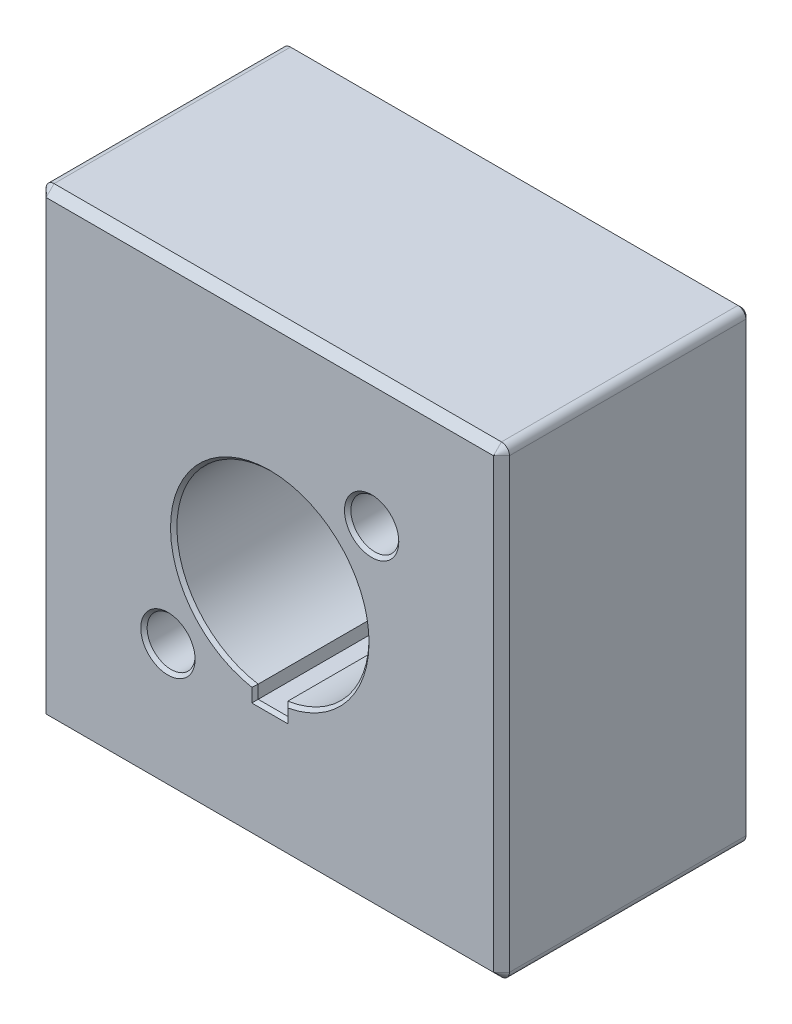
ISO-10303-21;
HEADER;
FILE_DESCRIPTION(('STEP AP214'),'2;1');
FILE_NAME('part.step','',(''),(''),'','','');
FILE_SCHEMA(('AUTOMOTIVE_DESIGN { 1 0 10303 214 1 1 1 1 }'));
ENDSEC;
DATA;
#1=APPLICATION_CONTEXT('core data for automotive mechanical design processes');
#2=APPLICATION_PROTOCOL_DEFINITION('international standard','automotive_design',2000,#1);
#3=PRODUCT_CONTEXT('',#1,'mechanical');
#4=PRODUCT('Part','Part','',(#3));
#5=PRODUCT_RELATED_PRODUCT_CATEGORY('part','',(#4));
#6=PRODUCT_DEFINITION_FORMATION('','',#4);
#7=PRODUCT_DEFINITION_CONTEXT('part definition',#1,'design');
#8=PRODUCT_DEFINITION('design','',#6,#7);
#9=PRODUCT_DEFINITION_SHAPE('','',#8);
#10=(LENGTH_UNIT() NAMED_UNIT(*) SI_UNIT(.MILLI.,.METRE.));
#11=(NAMED_UNIT(*) PLANE_ANGLE_UNIT() SI_UNIT($,.RADIAN.));
#12=(NAMED_UNIT(*) SI_UNIT($,.STERADIAN.) SOLID_ANGLE_UNIT());
#13=UNCERTAINTY_MEASURE_WITH_UNIT(LENGTH_MEASURE(1.E-05),#10,'distance_accuracy_value','');
#14=(GEOMETRIC_REPRESENTATION_CONTEXT(3) GLOBAL_UNCERTAINTY_ASSIGNED_CONTEXT((#13)) GLOBAL_UNIT_ASSIGNED_CONTEXT((#10,
#11,#12)) REPRESENTATION_CONTEXT('',''));
#15=CARTESIAN_POINT('',(0.,0.,0.));
#16=DIRECTION('',(0.,0.,1.));
#17=DIRECTION('',(1.,0.,0.));
#18=AXIS2_PLACEMENT_3D('',#15,#16,#17);
#19=CARTESIAN_POINT('',(-42.7499999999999,42.75,18.));
#20=DIRECTION('',(0.,0.,-1.));
#21=DIRECTION('',(-1.,0.,0.));
#22=AXIS2_PLACEMENT_3D('',#19,#20,#21);
#23=PLANE('',#22);
#24=CARTESIAN_POINT('',(-42.7499999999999,42.75,18.));
#25=DIRECTION('',(0.,0.,1.));
#26=DIRECTION('',(1.,0.,0.));
#27=AXIS2_PLACEMENT_3D('',#24,#25,#26);
#28=CIRCLE('',#27,2.);
#29=CARTESIAN_POINT('',(-40.7499999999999,42.75,18.));
#30=VERTEX_POINT('',#29);
#31=EDGE_CURVE('E20',#30,#30,#28,.F.);
#32=ORIENTED_EDGE('',*,*,#31,.T.);
#33=EDGE_LOOP('',(#32));
#34=FACE_BOUND('',#33,.T.);
#35=ADVANCED_FACE('F17',(#34),#23,.T.);
#36=CARTESIAN_POINT('',(5.25000000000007,42.7500000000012,18.));
#37=DIRECTION('',(0.,0.,-1.));
#38=DIRECTION('',(-1.,0.,0.));
#39=AXIS2_PLACEMENT_3D('',#36,#37,#38);
#40=PLANE('',#39);
#41=CARTESIAN_POINT('',(5.25000000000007,42.7500000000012,18.));
#42=DIRECTION('',(0.,0.,1.));
#43=DIRECTION('',(1.,0.,0.));
#44=AXIS2_PLACEMENT_3D('',#41,#42,#43);
#45=CIRCLE('',#44,2.);
#46=CARTESIAN_POINT('',(7.25000000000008,42.7500000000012,18.));
#47=VERTEX_POINT('',#46);
#48=EDGE_CURVE('E1369',#47,#47,#45,.F.);
#49=ORIENTED_EDGE('',*,*,#48,.T.);
#50=EDGE_LOOP('',(#49));
#51=FACE_BOUND('',#50,.T.);
#52=ADVANCED_FACE('F332',(#51),#40,.T.);
#53=CARTESIAN_POINT('',(5.25000000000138,-5.24999999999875,18.));
#54=DIRECTION('',(0.,0.,-1.));
#55=DIRECTION('',(-1.,0.,0.));
#56=AXIS2_PLACEMENT_3D('',#53,#54,#55);
#57=PLANE('',#56);
#58=CARTESIAN_POINT('',(5.25000000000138,-5.24999999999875,18.));
#59=DIRECTION('',(0.,0.,1.));
#60=DIRECTION('',(1.,0.,0.));
#61=AXIS2_PLACEMENT_3D('',#58,#59,#60);
#62=CIRCLE('',#61,2.00000000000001);
#63=CARTESIAN_POINT('',(7.25000000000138,-5.24999999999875,18.));
#64=VERTEX_POINT('',#63);
#65=EDGE_CURVE('E1367',#64,#64,#62,.F.);
#66=ORIENTED_EDGE('',*,*,#65,.T.);
#67=EDGE_LOOP('',(#66));
#68=FACE_BOUND('',#67,.T.);
#69=ADVANCED_FACE('F329',(#68),#57,.T.);
#70=CARTESIAN_POINT('',(-42.7499999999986,-5.25000000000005,18.));
#71=DIRECTION('',(0.,0.,-1.));
#72=DIRECTION('',(-1.,0.,0.));
#73=AXIS2_PLACEMENT_3D('',#70,#71,#72);
#74=PLANE('',#73);
#75=CARTESIAN_POINT('',(-42.7499999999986,-5.25000000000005,18.));
#76=DIRECTION('',(0.,0.,1.));
#77=DIRECTION('',(1.,0.,0.));
#78=AXIS2_PLACEMENT_3D('',#75,#76,#77);
#79=CIRCLE('',#78,2.);
#80=CARTESIAN_POINT('',(-40.7499999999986,-5.25000000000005,18.));
#81=VERTEX_POINT('',#80);
#82=EDGE_CURVE('E1362',#81,#81,#79,.F.);
#83=ORIENTED_EDGE('',*,*,#82,.T.);
#84=EDGE_LOOP('',(#83));
#85=FACE_BOUND('',#84,.T.);
#86=ADVANCED_FACE('F325',(#85),#74,.T.);
#87=CARTESIAN_POINT('',(0.,0.,3.));
#88=DIRECTION('',(0.,0.,1.));
#89=DIRECTION('',(1.,0.,0.));
#90=AXIS2_PLACEMENT_3D('',#87,#88,#89);
#91=PLANE('',#90);
#92=CARTESIAN_POINT('',(-5.25000000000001,8.75000000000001,3.));
#93=DIRECTION('',(0.,0.,-1.));
#94=DIRECTION('',(-1.,0.,0.));
#95=AXIS2_PLACEMENT_3D('',#92,#93,#94);
#96=CIRCLE('',#95,4.);
#97=CARTESIAN_POINT('',(-9.25000000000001,8.75000000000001,3.));
#98=VERTEX_POINT('',#97);
#99=EDGE_CURVE('E1359',#98,#98,#96,.T.);
#100=ORIENTED_EDGE('',*,*,#99,.T.);
#101=EDGE_LOOP('',(#100));
#102=FACE_BOUND('',#101,.T.);
#103=ADVANCED_FACE('F321',(#102),#91,.F.);
#104=CARTESIAN_POINT('',(0.,0.,3.));
#105=DIRECTION('',(0.,0.,1.));
#106=DIRECTION('',(1.,0.,0.));
#107=AXIS2_PLACEMENT_3D('',#104,#105,#106);
#108=PLANE('',#107);
#109=CARTESIAN_POINT('',(-32.25,28.75,3.));
#110=DIRECTION('',(0.,0.,-1.));
#111=DIRECTION('',(-1.,0.,0.));
#112=AXIS2_PLACEMENT_3D('',#109,#110,#111);
#113=CIRCLE('',#112,4.);
#114=CARTESIAN_POINT('',(-36.25,28.75,3.));
#115=VERTEX_POINT('',#114);
#116=EDGE_CURVE('E912',#115,#115,#113,.T.);
#117=ORIENTED_EDGE('',*,*,#116,.T.);
#118=EDGE_LOOP('',(#117));
#119=FACE_BOUND('',#118,.T.);
#120=ADVANCED_FACE('F317',(#119),#108,.F.);
#121=CARTESIAN_POINT('',(-42.7499999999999,42.75,0.));
#122=DIRECTION('',(0.,0.,1.));
#123=DIRECTION('',(1.,0.,0.));
#124=AXIS2_PLACEMENT_3D('',#121,#122,#123);
#125=CYLINDRICAL_SURFACE('',#124,2.);
#126=ORIENTED_EDGE('',*,*,#31,.F.);
#127=EDGE_LOOP('',(#126));
#128=FACE_BOUND('',#127,.T.);
#129=CARTESIAN_POINT('',(-42.7499999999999,42.75,0.399999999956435));
#130=DIRECTION('',(0.,0.,-1.));
#131=DIRECTION('',(-1.,0.,0.));
#132=AXIS2_PLACEMENT_3D('',#129,#130,#131);
#133=CIRCLE('',#132,1.99999999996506);
#134=CARTESIAN_POINT('',(-44.749999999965,42.75,0.399999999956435));
#135=VERTEX_POINT('',#134);
#136=EDGE_CURVE('E908',#135,#135,#133,.T.);
#137=ORIENTED_EDGE('',*,*,#136,.T.);
#138=EDGE_LOOP('',(#137));
#139=FACE_BOUND('',#138,.T.);
#140=ADVANCED_FACE('F313',(#128,#139),#125,.F.);
#141=CARTESIAN_POINT('',(5.25000000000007,42.7500000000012,0.));
#142=DIRECTION('',(0.,0.,1.));
#143=DIRECTION('',(1.,0.,0.));
#144=AXIS2_PLACEMENT_3D('',#141,#142,#143);
#145=CYLINDRICAL_SURFACE('',#144,2.);
#146=ORIENTED_EDGE('',*,*,#48,.F.);
#147=EDGE_LOOP('',(#146));
#148=FACE_BOUND('',#147,.T.);
#149=CARTESIAN_POINT('',(5.25000000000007,42.7500000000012,0.399999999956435));
#150=DIRECTION('',(0.,0.,-1.));
#151=DIRECTION('',(-1.,0.,0.));
#152=AXIS2_PLACEMENT_3D('',#149,#150,#151);
#153=CIRCLE('',#152,1.99999999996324);
#154=CARTESIAN_POINT('',(3.25000000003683,42.7500000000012,0.399999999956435));
#155=VERTEX_POINT('',#154);
#156=EDGE_CURVE('E911',#155,#155,#153,.T.);
#157=ORIENTED_EDGE('',*,*,#156,.T.);
#158=EDGE_LOOP('',(#157));
#159=FACE_BOUND('',#158,.T.);
#160=ADVANCED_FACE('F309',(#148,#159),#145,.F.);
#161=CARTESIAN_POINT('',(5.25000000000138,-5.24999999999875,0.));
#162=DIRECTION('',(0.,0.,1.));
#163=DIRECTION('',(1.,0.,0.));
#164=AXIS2_PLACEMENT_3D('',#161,#162,#163);
#165=CYLINDRICAL_SURFACE('',#164,2.00000000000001);
#166=ORIENTED_EDGE('',*,*,#65,.F.);
#167=EDGE_LOOP('',(#166));
#168=FACE_BOUND('',#167,.T.);
#169=CARTESIAN_POINT('',(5.25000000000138,-5.24999999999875,0.399999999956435));
#170=DIRECTION('',(0.,0.,-1.));
#171=DIRECTION('',(-1.,0.,0.));
#172=AXIS2_PLACEMENT_3D('',#169,#170,#171);
#173=CIRCLE('',#172,2.00000000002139);
#174=CARTESIAN_POINT('',(3.24999999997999,-5.24999999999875,0.399999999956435));
#175=VERTEX_POINT('',#174);
#176=EDGE_CURVE('E917',#175,#175,#173,.T.);
#177=ORIENTED_EDGE('',*,*,#176,.T.);
#178=EDGE_LOOP('',(#177));
#179=FACE_BOUND('',#178,.T.);
#180=ADVANCED_FACE('F305',(#168,#179),#165,.F.);
#181=CARTESIAN_POINT('',(-42.7499999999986,-5.25000000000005,0.));
#182=DIRECTION('',(0.,0.,1.));
#183=DIRECTION('',(1.,0.,0.));
#184=AXIS2_PLACEMENT_3D('',#181,#182,#183);
#185=CYLINDRICAL_SURFACE('',#184,2.);
#186=ORIENTED_EDGE('',*,*,#82,.F.);
#187=EDGE_LOOP('',(#186));
#188=FACE_BOUND('',#187,.T.);
#189=CARTESIAN_POINT('',(-42.7499999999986,-5.25000000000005,0.399999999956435));
#190=DIRECTION('',(0.,0.,-1.));
#191=DIRECTION('',(-1.,0.,0.));
#192=AXIS2_PLACEMENT_3D('',#189,#190,#191);
#193=CIRCLE('',#192,1.99999999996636);
#194=CARTESIAN_POINT('',(-44.749999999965,-5.25000000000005,0.399999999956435));
#195=VERTEX_POINT('',#194);
#196=EDGE_CURVE('E922',#195,#195,#193,.T.);
#197=ORIENTED_EDGE('',*,*,#196,.T.);
#198=EDGE_LOOP('',(#197));
#199=FACE_BOUND('',#198,.T.);
#200=ADVANCED_FACE('F301',(#188,#199),#185,.F.);
#201=CARTESIAN_POINT('',(-5.25000000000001,8.75000000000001,3.));
#202=DIRECTION('',(0.,0.,-1.));
#203=DIRECTION('',(-1.,0.,0.));
#204=AXIS2_PLACEMENT_3D('',#201,#202,#203);
#205=CYLINDRICAL_SURFACE('',#204,4.);
#206=ORIENTED_EDGE('',*,*,#99,.F.);
#207=EDGE_LOOP('',(#206));
#208=FACE_BOUND('',#207,.T.);
#209=CARTESIAN_POINT('',(-5.25000000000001,8.75000000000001,0.400000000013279));
#210=DIRECTION('',(0.,0.,-1.));
#211=DIRECTION('',(-1.,0.,0.));
#212=AXIS2_PLACEMENT_3D('',#209,#210,#211);
#213=CIRCLE('',#212,4.00000000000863);
#214=CARTESIAN_POINT('',(-9.25000000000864,8.75000000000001,0.400000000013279));
#215=VERTEX_POINT('',#214);
#216=EDGE_CURVE('E186',#215,#215,#213,.T.);
#217=ORIENTED_EDGE('',*,*,#216,.T.);
#218=EDGE_LOOP('',(#217));
#219=FACE_BOUND('',#218,.T.);
#220=ADVANCED_FACE('F297',(#208,#219),#205,.F.);
#221=CARTESIAN_POINT('',(-32.25,28.75,3.));
#222=DIRECTION('',(0.,0.,-1.));
#223=DIRECTION('',(-1.,0.,0.));
#224=AXIS2_PLACEMENT_3D('',#221,#222,#223);
#225=CYLINDRICAL_SURFACE('',#224,4.);
#226=ORIENTED_EDGE('',*,*,#116,.F.);
#227=EDGE_LOOP('',(#226));
#228=FACE_BOUND('',#227,.T.);
#229=CARTESIAN_POINT('',(-32.25,28.75,0.400000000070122));
#230=DIRECTION('',(0.,0.,-1.));
#231=DIRECTION('',(-1.,0.,0.));
#232=AXIS2_PLACEMENT_3D('',#229,#230,#231);
#233=CIRCLE('',#232,3.99999999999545);
#234=CARTESIAN_POINT('',(-36.2499999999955,28.75,0.400000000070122));
#235=VERTEX_POINT('',#234);
#236=EDGE_CURVE('E185',#235,#235,#233,.T.);
#237=ORIENTED_EDGE('',*,*,#236,.T.);
#238=EDGE_LOOP('',(#237));
#239=FACE_BOUND('',#238,.T.);
#240=ADVANCED_FACE('F293',(#228,#239),#225,.F.);
#241=CARTESIAN_POINT('',(-6.,31.5,5.6843418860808E-11));
#242=DIRECTION('',(0.,0.,-1.));
#243=DIRECTION('',(-1.,0.,0.));
#244=AXIS2_PLACEMENT_3D('',#241,#242,#243);
#245=CONICAL_SURFACE('',#244,2.39999999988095,0.785398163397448);
#246=CARTESIAN_POINT('',(-6.,31.5,0.));
#247=DIRECTION('',(0.,0.,-1.));
#248=DIRECTION('',(-1.,0.,0.));
#249=AXIS2_PLACEMENT_3D('',#246,#247,#248);
#250=CIRCLE('',#249,2.39999999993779);
#251=CARTESIAN_POINT('',(-8.39999999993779,31.5,0.));
#252=VERTEX_POINT('',#251);
#253=EDGE_CURVE('E232',#252,#252,#250,.F.);
#254=ORIENTED_EDGE('',*,*,#253,.F.);
#255=EDGE_LOOP('',(#254));
#256=FACE_BOUND('',#255,.T.);
#257=CARTESIAN_POINT('',(-6.,31.5,0.400000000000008));
#258=DIRECTION('',(0.,0.,-1.));
#259=DIRECTION('',(-1.,0.,0.));
#260=AXIS2_PLACEMENT_3D('',#257,#258,#259);
#261=CIRCLE('',#260,2.);
#262=CARTESIAN_POINT('',(-8.,31.5,0.400000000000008));
#263=VERTEX_POINT('',#262);
#264=EDGE_CURVE('E679',#263,#263,#261,.F.);
#265=ORIENTED_EDGE('',*,*,#264,.T.);
#266=EDGE_LOOP('',(#265));
#267=FACE_BOUND('',#266,.T.);
#268=ADVANCED_FACE('F289',(#256,#267),#245,.F.);
#269=CARTESIAN_POINT('',(-31.5,6.,1.13686837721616E-10));
#270=DIRECTION('',(0.,0.,-1.));
#271=DIRECTION('',(-1.,0.,0.));
#272=AXIS2_PLACEMENT_3D('',#269,#270,#271);
#273=CONICAL_SURFACE('',#272,2.39999999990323,0.785398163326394);
#274=CARTESIAN_POINT('',(-31.5,6.,5.6843418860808E-11));
#275=DIRECTION('',(0.,0.,-1.));
#276=DIRECTION('',(-1.,0.,0.));
#277=AXIS2_PLACEMENT_3D('',#274,#275,#276);
#278=CIRCLE('',#277,2.39999999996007);
#279=CARTESIAN_POINT('',(-33.8999999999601,6.,5.6843418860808E-11));
#280=VERTEX_POINT('',#279);
#281=EDGE_CURVE('E229',#280,#280,#278,.F.);
#282=ORIENTED_EDGE('',*,*,#281,.F.);
#283=EDGE_LOOP('',(#282));
#284=FACE_BOUND('',#283,.T.);
#285=CARTESIAN_POINT('',(-31.5,6.,0.400000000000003));
#286=DIRECTION('',(0.,0.,-1.));
#287=DIRECTION('',(-1.,0.,0.));
#288=AXIS2_PLACEMENT_3D('',#285,#286,#287);
#289=CIRCLE('',#288,2.);
#290=CARTESIAN_POINT('',(-33.5,6.,0.400000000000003));
#291=VERTEX_POINT('',#290);
#292=EDGE_CURVE('E675',#291,#291,#289,.F.);
#293=ORIENTED_EDGE('',*,*,#292,.T.);
#294=EDGE_LOOP('',(#293));
#295=FACE_BOUND('',#294,.T.);
#296=ADVANCED_FACE('F285',(#284,#295),#273,.F.);
#297=CARTESIAN_POINT('',(-42.7499999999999,42.75,-5.6843418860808E-11));
#298=DIRECTION('',(0.,0.,-1.));
#299=DIRECTION('',(-1.,0.,0.));
#300=AXIS2_PLACEMENT_3D('',#297,#298,#299);
#301=CONICAL_SURFACE('',#300,2.39999999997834,0.785398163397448);
#302=CARTESIAN_POINT('',(-42.7499999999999,42.75,-5.6843418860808E-11));
#303=DIRECTION('',(0.,0.,-1.));
#304=DIRECTION('',(-1.,0.,0.));
#305=AXIS2_PLACEMENT_3D('',#302,#303,#304);
#306=CIRCLE('',#305,2.39999999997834);
#307=CARTESIAN_POINT('',(-45.1499999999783,42.75,-5.6843418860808E-11));
#308=VERTEX_POINT('',#307);
#309=EDGE_CURVE('E226',#308,#308,#306,.F.);
#310=ORIENTED_EDGE('',*,*,#309,.F.);
#311=EDGE_LOOP('',(#310));
#312=FACE_BOUND('',#311,.T.);
#313=ORIENTED_EDGE('',*,*,#136,.F.);
#314=EDGE_LOOP('',(#313));
#315=FACE_BOUND('',#314,.T.);
#316=ADVANCED_FACE('F281',(#312,#315),#301,.F.);
#317=CARTESIAN_POINT('',(5.25000000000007,42.7500000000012,5.6843418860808E-11));
#318=DIRECTION('',(0.,0.,-1.));
#319=DIRECTION('',(-1.,0.,0.));
#320=AXIS2_PLACEMENT_3D('',#317,#318,#319);
#321=CONICAL_SURFACE('',#320,2.39999999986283,0.785398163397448);
#322=CARTESIAN_POINT('',(5.25000000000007,42.7500000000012,0.));
#323=DIRECTION('',(0.,0.,-1.));
#324=DIRECTION('',(-1.,0.,0.));
#325=AXIS2_PLACEMENT_3D('',#322,#323,#324);
#326=CIRCLE('',#325,2.39999999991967);
#327=CARTESIAN_POINT('',(2.8500000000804,42.7500000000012,0.));
#328=VERTEX_POINT('',#327);
#329=EDGE_CURVE('E223',#328,#328,#326,.F.);
#330=ORIENTED_EDGE('',*,*,#329,.F.);
#331=EDGE_LOOP('',(#330));
#332=FACE_BOUND('',#331,.T.);
#333=ORIENTED_EDGE('',*,*,#156,.F.);
#334=EDGE_LOOP('',(#333));
#335=FACE_BOUND('',#334,.T.);
#336=ADVANCED_FACE('F277',(#332,#335),#321,.F.);
#337=CARTESIAN_POINT('',(5.25000000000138,-5.24999999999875,5.6843418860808E-11));
#338=DIRECTION('',(0.,0.,-1.));
#339=DIRECTION('',(-1.,0.,0.));
#340=AXIS2_PLACEMENT_3D('',#337,#338,#339);
#341=CONICAL_SURFACE('',#340,2.39999999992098,0.785398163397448);
#342=CARTESIAN_POINT('',(5.25000000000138,-5.24999999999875,0.));
#343=DIRECTION('',(0.,0.,-1.));
#344=DIRECTION('',(-1.,0.,0.));
#345=AXIS2_PLACEMENT_3D('',#342,#343,#344);
#346=CIRCLE('',#345,2.39999999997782);
#347=CARTESIAN_POINT('',(2.85000000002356,-5.24999999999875,0.));
#348=VERTEX_POINT('',#347);
#349=EDGE_CURVE('E220',#348,#348,#346,.F.);
#350=ORIENTED_EDGE('',*,*,#349,.F.);
#351=EDGE_LOOP('',(#350));
#352=FACE_BOUND('',#351,.T.);
#353=ORIENTED_EDGE('',*,*,#176,.F.);
#354=EDGE_LOOP('',(#353));
#355=FACE_BOUND('',#354,.T.);
#356=ADVANCED_FACE('F273',(#352,#355),#341,.F.);
#357=CARTESIAN_POINT('',(-42.7499999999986,-5.25000000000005,-5.6843418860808E-11));
#358=DIRECTION('',(0.,0.,-1.));
#359=DIRECTION('',(-1.,0.,0.));
#360=AXIS2_PLACEMENT_3D('',#357,#358,#359);
#361=CONICAL_SURFACE('',#360,2.39999999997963,0.785398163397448);
#362=CARTESIAN_POINT('',(-42.7499999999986,-5.25000000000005,-5.6843418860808E-11));
#363=DIRECTION('',(0.,0.,-1.));
#364=DIRECTION('',(-1.,0.,0.));
#365=AXIS2_PLACEMENT_3D('',#362,#363,#364);
#366=CIRCLE('',#365,2.39999999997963);
#367=CARTESIAN_POINT('',(-45.1499999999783,-5.25000000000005,-5.6843418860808E-11));
#368=VERTEX_POINT('',#367);
#369=EDGE_CURVE('E193',#368,#368,#366,.F.);
#370=ORIENTED_EDGE('',*,*,#369,.F.);
#371=EDGE_LOOP('',(#370));
#372=FACE_BOUND('',#371,.T.);
#373=ORIENTED_EDGE('',*,*,#196,.F.);
#374=EDGE_LOOP('',(#373));
#375=FACE_BOUND('',#374,.T.);
#376=ADVANCED_FACE('F270',(#372,#375),#361,.F.);
#377=CARTESIAN_POINT('',(-5.25000000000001,8.75000000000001,-5.6843418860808E-11));
#378=DIRECTION('',(0.,0.,-1.));
#379=DIRECTION('',(-1.,0.,0.));
#380=AXIS2_PLACEMENT_3D('',#377,#378,#379);
#381=CONICAL_SURFACE('',#380,4.40000000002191,0.785398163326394);
#382=CARTESIAN_POINT('',(-5.25000000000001,8.75000000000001,-5.6843418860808E-11));
#383=DIRECTION('',(0.,0.,-1.));
#384=DIRECTION('',(-1.,0.,0.));
#385=AXIS2_PLACEMENT_3D('',#382,#383,#384);
#386=CIRCLE('',#385,4.40000000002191);
#387=CARTESIAN_POINT('',(-9.00928191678,11.036438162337,-2.97831944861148E-11));
#388=VERTEX_POINT('',#387);
#389=CARTESIAN_POINT('',(-8.53268996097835,11.6798373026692,-2.97831632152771E-11));
#390=VERTEX_POINT('',#389);
#391=EDGE_CURVE('E188',#388,#390,#386,.F.);
#392=ORIENTED_EDGE('',*,*,#391,.F.);
#393=CARTESIAN_POINT('',(-8.53268996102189,11.6798373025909,-2.18725948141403E-11));
#394=CARTESIAN_POINT('',(-8.61528250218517,11.5749452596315,0.00823412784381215));
#395=CARTESIAN_POINT('',(-8.69629476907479,11.468882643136,0.0123511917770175));
#396=CARTESIAN_POINT('',(-8.8551587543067,11.2544162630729,0.0123511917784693));
#397=CARTESIAN_POINT('',(-8.93301047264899,11.1460124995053,0.00823412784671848));
#398=CARTESIAN_POINT('',(-9.00928191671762,11.0364381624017,-1.75089705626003E-11));
#399=B_SPLINE_CURVE_WITH_KNOTS('',3,(#393,#394,#395,#396,#397,#398),.UNSPECIFIED.,.F.,.F.,(4,2,
4),(0.,0.400578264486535,0.801156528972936),.UNSPECIFIED.);
#400=EDGE_CURVE('E175',#390,#388,#399,.T.);
#401=ORIENTED_EDGE('',*,*,#400,.F.);
#402=EDGE_LOOP('',(#392,#401));
#403=FACE_BOUND('',#402,.T.);
#404=ORIENTED_EDGE('',*,*,#216,.F.);
#405=EDGE_LOOP('',(#404));
#406=FACE_BOUND('',#405,.T.);
#407=ADVANCED_FACE('F189',(#403,#406),#381,.F.);
#408=CARTESIAN_POINT('',(-32.25,28.75,1.70530256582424E-10));
#409=DIRECTION('',(0.,0.,-1.));
#410=DIRECTION('',(-1.,0.,0.));
#411=AXIS2_PLACEMENT_3D('',#408,#409,#410);
#412=CONICAL_SURFACE('',#411,4.39999999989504,0.785398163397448);
#413=CARTESIAN_POINT('',(-28.9673100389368,25.82016269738,2.44073699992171E-11));
#414=CARTESIAN_POINT('',(-28.8847174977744,25.9250547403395,0.00823412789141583));
#415=CARTESIAN_POINT('',(-28.8037052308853,26.0311173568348,0.0123511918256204));
#416=CARTESIAN_POINT('',(-28.6448412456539,26.2455837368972,0.0123511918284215));
#417=CARTESIAN_POINT('',(-28.5669895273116,26.3539875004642,0.00823412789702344));
#418=CARTESIAN_POINT('',(-28.4907180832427,26.4635618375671,3.28266461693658E-11));
#419=B_SPLINE_CURVE_WITH_KNOTS('',3,(#413,#414,#415,#416,#417,#418),.UNSPECIFIED.,.F.,.F.,(4,2,
4),(0.,0.400578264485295,0.801156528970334),.UNSPECIFIED.);
#420=CARTESIAN_POINT('',(-28.9673100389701,25.8201626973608,3.73870846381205E-11));
#421=VERTEX_POINT('',#420);
#422=CARTESIAN_POINT('',(-28.4907180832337,26.463561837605,3.73873053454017E-11));
#423=VERTEX_POINT('',#422);
#424=EDGE_CURVE('E244',#421,#423,#419,.T.);
#425=ORIENTED_EDGE('',*,*,#424,.F.);
#426=CARTESIAN_POINT('',(-32.25,28.75,5.6843418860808E-11));
#427=DIRECTION('',(0.,0.,-1.));
#428=DIRECTION('',(-1.,0.,0.));
#429=AXIS2_PLACEMENT_3D('',#426,#427,#428);
#430=CIRCLE('',#429,4.40000000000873);
#431=EDGE_CURVE('E192',#423,#421,#430,.F.);
#432=ORIENTED_EDGE('',*,*,#431,.F.);
#433=EDGE_LOOP('',(#425,#432));
#434=FACE_BOUND('',#433,.T.);
#435=ORIENTED_EDGE('',*,*,#236,.F.);
#436=EDGE_LOOP('',(#435));
#437=FACE_BOUND('',#436,.T.);
#438=ADVANCED_FACE('F259',(#434,#437),#412,.F.);
#439=CARTESIAN_POINT('',(-16.8999999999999,11.2199999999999,0.400000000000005));
#440=DIRECTION('',(-0.707106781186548,0.,-0.707106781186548));
#441=DIRECTION('',(-0.707106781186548,0.,0.707106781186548));
#442=AXIS2_PLACEMENT_3D('',#439,#440,#441);
#443=PLANE('',#442);
#444=CARTESIAN_POINT('',(-16.8999999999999,6.8681598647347,0.400000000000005));
#445=CARTESIAN_POINT('',(-16.7028026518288,6.69929014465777,0.202802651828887));
#446=CARTESIAN_POINT('',(-16.4999999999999,6.53042042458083,0.));
#447=B_SPLINE_CURVE_WITH_KNOTS('',2,(#444,#445,#446),.UNSPECIFIED.,.F.,.F.,(3,3),(0.,1.),.UNSPECIFIED.);
#448=CARTESIAN_POINT('',(-16.8999999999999,6.8681598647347,0.400000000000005));
#449=VERTEX_POINT('',#448);
#450=CARTESIAN_POINT('',(-16.4999999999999,6.53042042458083,0.));
#451=VERTEX_POINT('',#450);
#452=EDGE_CURVE('E250',#449,#451,#447,.T.);
#453=ORIENTED_EDGE('',*,*,#452,.T.);
#454=DIRECTION('',(0.,1.,0.));
#455=VECTOR('',#454,1.);
#456=CARTESIAN_POINT('',(-16.4999999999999,0.,0.));
#457=LINE('',#456,#455);
#458=CARTESIAN_POINT('',(-16.4999999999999,4.81999999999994,0.));
#459=VERTEX_POINT('',#458);
#460=EDGE_CURVE('E199',#459,#451,#457,.T.);
#461=ORIENTED_EDGE('',*,*,#460,.F.);
#462=DIRECTION('',(0.577350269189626,-0.577350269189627,-0.577350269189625));
#463=VECTOR('',#462,1.);
#464=CARTESIAN_POINT('',(-16.8999999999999,5.21999999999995,0.400000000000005));
#465=LINE('',#464,#463);
#466=CARTESIAN_POINT('',(-16.8999999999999,5.21999999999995,0.400000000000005));
#467=VERTEX_POINT('',#466);
#468=EDGE_CURVE('E214',#467,#459,#465,.T.);
#469=ORIENTED_EDGE('',*,*,#468,.F.);
#470=DIRECTION('',(0.,1.,0.));
#471=VECTOR('',#470,1.);
#472=CARTESIAN_POINT('',(-16.8999999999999,11.2199999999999,0.400000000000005));
#473=LINE('',#472,#471);
#474=EDGE_CURVE('E210',#467,#449,#473,.T.);
#475=ORIENTED_EDGE('',*,*,#474,.T.);
#476=EDGE_LOOP('',(#453,#461,#469,#475));
#477=FACE_BOUND('',#476,.T.);
#478=ADVANCED_FACE('F263',(#477),#443,.T.);
#479=CARTESIAN_POINT('',(-20.5999999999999,11.2199999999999,0.400000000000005));
#480=DIRECTION('',(0.707106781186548,0.,-0.707106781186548));
#481=DIRECTION('',(-0.707106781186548,0.,-0.707106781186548));
#482=AXIS2_PLACEMENT_3D('',#479,#480,#481);
#483=PLANE('',#482);
#484=CARTESIAN_POINT('',(-20.9999999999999,6.53042042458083,0.));
#485=CARTESIAN_POINT('',(-20.7971973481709,6.69929014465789,0.202802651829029));
#486=CARTESIAN_POINT('',(-20.5999999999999,6.8681598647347,0.400000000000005));
#487=B_SPLINE_CURVE_WITH_KNOTS('',2,(#484,#485,#486),.UNSPECIFIED.,.F.,.F.,(3,3),(0.,1.),.UNSPECIFIED.);
#488=CARTESIAN_POINT('',(-20.9999999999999,6.53042042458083,0.));
#489=VERTEX_POINT('',#488);
#490=CARTESIAN_POINT('',(-20.5999999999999,6.8681598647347,0.400000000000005));
#491=VERTEX_POINT('',#490);
#492=EDGE_CURVE('E200',#489,#491,#487,.T.);
#493=ORIENTED_EDGE('',*,*,#492,.T.);
#494=DIRECTION('',(0.,1.,0.));
#495=VECTOR('',#494,1.);
#496=CARTESIAN_POINT('',(-20.5999999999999,11.2199999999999,0.400000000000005));
#497=LINE('',#496,#495);
#498=CARTESIAN_POINT('',(-20.5999999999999,5.21999999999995,0.400000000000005));
#499=VERTEX_POINT('',#498);
#500=EDGE_CURVE('E530',#491,#499,#497,.F.);
#501=ORIENTED_EDGE('',*,*,#500,.T.);
#502=DIRECTION('',(0.577350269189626,0.577350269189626,0.577350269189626));
#503=VECTOR('',#502,1.);
#504=CARTESIAN_POINT('',(-20.9999999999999,4.81999999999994,0.));
#505=LINE('',#504,#503);
#506=CARTESIAN_POINT('',(-20.9999999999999,4.81999999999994,0.));
#507=VERTEX_POINT('',#506);
#508=EDGE_CURVE('E595',#507,#499,#505,.T.);
#509=ORIENTED_EDGE('',*,*,#508,.F.);
#510=DIRECTION('',(0.,1.,0.));
#511=VECTOR('',#510,1.);
#512=CARTESIAN_POINT('',(-20.9999999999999,0.,0.));
#513=LINE('',#512,#511);
#514=EDGE_CURVE('E216',#489,#507,#513,.F.);
#515=ORIENTED_EDGE('',*,*,#514,.F.);
#516=EDGE_LOOP('',(#493,#501,#509,#515));
#517=FACE_BOUND('',#516,.T.);
#518=ADVANCED_FACE('F689',(#517),#483,.T.);
#519=CARTESIAN_POINT('',(-6.,31.5,3.));
#520=DIRECTION('',(0.,0.,-1.));
#521=DIRECTION('',(-1.,0.,0.));
#522=AXIS2_PLACEMENT_3D('',#519,#520,#521);
#523=CYLINDRICAL_SURFACE('',#522,2.);
#524=CARTESIAN_POINT('',(-6.,31.5,4.));
#525=DIRECTION('',(0.,0.,-1.));
#526=DIRECTION('',(-1.,0.,0.));
#527=AXIS2_PLACEMENT_3D('',#524,#525,#526);
#528=CIRCLE('',#527,2.);
#529=CARTESIAN_POINT('',(-8.,31.5,4.));
#530=VERTEX_POINT('',#529);
#531=EDGE_CURVE('E539',#530,#530,#528,.F.);
#532=ORIENTED_EDGE('',*,*,#531,.T.);
#533=EDGE_LOOP('',(#532));
#534=FACE_BOUND('',#533,.T.);
#535=ORIENTED_EDGE('',*,*,#264,.F.);
#536=EDGE_LOOP('',(#535));
#537=FACE_BOUND('',#536,.T.);
#538=ADVANCED_FACE('F698',(#534,#537),#523,.F.);
#539=CARTESIAN_POINT('',(-31.5,6.,3.));
#540=DIRECTION('',(0.,0.,-1.));
#541=DIRECTION('',(-1.,0.,0.));
#542=AXIS2_PLACEMENT_3D('',#539,#540,#541);
#543=CYLINDRICAL_SURFACE('',#542,2.);
#544=CARTESIAN_POINT('',(-31.5,6.,4.));
#545=DIRECTION('',(0.,0.,-1.));
#546=DIRECTION('',(-1.,0.,0.));
#547=AXIS2_PLACEMENT_3D('',#544,#545,#546);
#548=CIRCLE('',#547,2.);
#549=CARTESIAN_POINT('',(-33.5,6.,4.));
#550=VERTEX_POINT('',#549);
#551=EDGE_CURVE('E654',#550,#550,#548,.F.);
#552=ORIENTED_EDGE('',*,*,#551,.T.);
#553=EDGE_LOOP('',(#552));
#554=FACE_BOUND('',#553,.T.);
#555=ORIENTED_EDGE('',*,*,#292,.F.);
#556=EDGE_LOOP('',(#555));
#557=FACE_BOUND('',#556,.T.);
#558=ADVANCED_FACE('F701',(#554,#557),#543,.F.);
#559=CARTESIAN_POINT('',(-46.7499999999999,-9.25000000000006,0.399999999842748));
#560=DIRECTION('',(0.,0.,1.));
#561=DIRECTION('',(1.,0.,0.));
#562=AXIS2_PLACEMENT_3D('',#559,#560,#561);
#563=CONICAL_SURFACE('',#562,0.999999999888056,0.785398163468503);
#564=DIRECTION('',(0.,0.707106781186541,-0.707106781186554));
#565=VECTOR('',#564,1.);
#566=CARTESIAN_POINT('',(-46.7500000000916,-499009.84999999,499000.));
#567=LINE('',#566,#565);
#568=CARTESIAN_POINT('',(-46.7499999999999,-9.84999999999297,1.42105565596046E-11));
#569=VERTEX_POINT('',#568);
#570=CARTESIAN_POINT('',(-46.7499999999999,-10.2499999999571,0.39999999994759));
#571=VERTEX_POINT('',#570);
#572=EDGE_CURVE('E678',#569,#571,#567,.F.);
#573=ORIENTED_EDGE('',*,*,#572,.T.);
#574=CARTESIAN_POINT('',(-46.7499999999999,-9.25000000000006,0.400000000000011));
#575=DIRECTION('',(0.,0.,1.));
#576=DIRECTION('',(1.,0.,0.));
#577=AXIS2_PLACEMENT_3D('',#574,#575,#576);
#578=CIRCLE('',#577,1.);
#579=CARTESIAN_POINT('',(-47.7500000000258,-9.25000000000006,0.400000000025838));
#580=VERTEX_POINT('',#579);
#581=EDGE_CURVE('E587',#580,#571,#578,.T.);
#582=ORIENTED_EDGE('',*,*,#581,.F.);
#583=DIRECTION('',(0.707106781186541,0.,-0.707106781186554));
#584=VECTOR('',#583,1.);
#585=CARTESIAN_POINT('',(-47.7499999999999,-9.25000000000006,0.400000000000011));
#586=LINE('',#585,#584);
#587=CARTESIAN_POINT('',(-47.3500000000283,-9.25000000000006,2.84223735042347E-11));
#588=VERTEX_POINT('',#587);
#589=EDGE_CURVE('E651',#580,#588,#586,.T.);
#590=ORIENTED_EDGE('',*,*,#589,.T.);
#591=CARTESIAN_POINT('',(-46.7499999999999,-9.25000000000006,5.68434730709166E-11));
#592=DIRECTION('',(0.,0.,1.));
#593=DIRECTION('',(1.,0.,0.));
#594=AXIS2_PLACEMENT_3D('',#591,#592,#593);
#595=CIRCLE('',#594,0.600000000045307);
#596=EDGE_CURVE('E237',#569,#588,#595,.F.);
#597=ORIENTED_EDGE('',*,*,#596,.F.);
#598=EDGE_LOOP('',(#573,#582,#590,#597));
#599=FACE_BOUND('',#598,.T.);
#600=ADVANCED_FACE('F705',(#599),#563,.T.);
#601=CARTESIAN_POINT('',(9.25000000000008,-9.25000000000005,0.399999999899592));
#602=DIRECTION('',(0.,0.,1.));
#603=DIRECTION('',(0.,-1.,0.));
#604=AXIS2_PLACEMENT_3D('',#601,#602,#603);
#605=CONICAL_SURFACE('',#604,0.999999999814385,0.785398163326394);
#606=DIRECTION('',(0.,-0.707106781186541,0.707106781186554));
#607=VECTOR('',#606,1.);
#608=CARTESIAN_POINT('',(9.25000000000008,-10.2500000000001,0.400000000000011));
#609=LINE('',#608,#607);
#610=CARTESIAN_POINT('',(9.25000000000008,-10.2500000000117,0.400000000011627));
#611=VERTEX_POINT('',#610);
#612=CARTESIAN_POINT('',(9.25000000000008,-9.85000000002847,2.84210046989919E-11));
#613=VERTEX_POINT('',#612);
#614=EDGE_CURVE('E586',#611,#613,#609,.F.);
#615=ORIENTED_EDGE('',*,*,#614,.T.);
#616=CARTESIAN_POINT('',(9.25000000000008,-9.25000000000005,5.6843418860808E-11));
#617=DIRECTION('',(0.,0.,1.));
#618=DIRECTION('',(0.,-1.,0.));
#619=AXIS2_PLACEMENT_3D('',#616,#617,#618);
#620=CIRCLE('',#619,0.600000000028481);
#621=CARTESIAN_POINT('',(9.84999999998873,-9.25000000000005,2.84218042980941E-11));
#622=VERTEX_POINT('',#621);
#623=EDGE_CURVE('E240',#622,#613,#620,.F.);
#624=ORIENTED_EDGE('',*,*,#623,.F.);
#625=DIRECTION('',(-0.707106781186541,0.,-0.707106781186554));
#626=VECTOR('',#625,1.);
#627=CARTESIAN_POINT('',(499000.,-9.25000000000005,498990.15000001));
#628=LINE('',#627,#626);
#629=CARTESIAN_POINT('',(10.2499999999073,-9.25000000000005,0.399999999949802));
#630=VERTEX_POINT('',#629);
#631=EDGE_CURVE('E876',#622,#630,#628,.F.);
#632=ORIENTED_EDGE('',*,*,#631,.T.);
#633=CARTESIAN_POINT('',(9.25000000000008,-9.25000000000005,0.400000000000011));
#634=DIRECTION('',(0.,0.,1.));
#635=DIRECTION('',(1.,0.,0.));
#636=AXIS2_PLACEMENT_3D('',#633,#634,#635);
#637=CIRCLE('',#636,1.);
#638=EDGE_CURVE('E583',#611,#630,#637,.T.);
#639=ORIENTED_EDGE('',*,*,#638,.F.);
#640=EDGE_LOOP('',(#615,#624,#632,#639));
#641=FACE_BOUND('',#640,.T.);
#642=ADVANCED_FACE('F709',(#641),#605,.T.);
#643=CARTESIAN_POINT('',(9.25000000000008,46.75,0.399999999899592));
#644=DIRECTION('',(0.,0.,1.));
#645=DIRECTION('',(0.,-1.,0.));
#646=AXIS2_PLACEMENT_3D('',#643,#644,#645);
#647=CONICAL_SURFACE('',#646,0.999999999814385,0.785398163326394);
#648=DIRECTION('',(0.707106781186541,0.,0.707106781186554));
#649=VECTOR('',#648,1.);
#650=CARTESIAN_POINT('',(10.2500000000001,46.75,0.400000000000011));
#651=LINE('',#650,#649);
#652=CARTESIAN_POINT('',(10.2499999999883,46.75,0.400000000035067));
#653=VERTEX_POINT('',#652);
#654=CARTESIAN_POINT('',(9.85000000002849,46.75,2.84218449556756E-11));
#655=VERTEX_POINT('',#654);
#656=EDGE_CURVE('E624',#653,#655,#651,.F.);
#657=ORIENTED_EDGE('',*,*,#656,.T.);
#658=CARTESIAN_POINT('',(9.25000000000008,46.75,5.6843418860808E-11));
#659=DIRECTION('',(0.,0.,1.));
#660=DIRECTION('',(0.,-1.,0.));
#661=AXIS2_PLACEMENT_3D('',#658,#659,#660);
#662=CIRCLE('',#661,0.600000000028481);
#663=CARTESIAN_POINT('',(9.25000000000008,47.3500000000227,2.8421709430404E-11));
#664=VERTEX_POINT('',#663);
#665=EDGE_CURVE('E235',#664,#655,#662,.F.);
#666=ORIENTED_EDGE('',*,*,#665,.F.);
#667=DIRECTION('',(0.,-0.707106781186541,-0.707106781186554));
#668=VECTOR('',#667,1.);
#669=CARTESIAN_POINT('',(9.25000000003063,499037.5,498990.15000001));
#670=LINE('',#669,#668);
#671=CARTESIAN_POINT('',(9.25000000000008,47.7499999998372,0.399999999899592));
#672=VERTEX_POINT('',#671);
#673=EDGE_CURVE('E243',#664,#672,#670,.F.);
#674=ORIENTED_EDGE('',*,*,#673,.T.);
#675=CARTESIAN_POINT('',(9.25000000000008,46.75,0.400000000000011));
#676=DIRECTION('',(0.,0.,1.));
#677=DIRECTION('',(1.,0.,0.));
#678=AXIS2_PLACEMENT_3D('',#675,#676,#677);
#679=CIRCLE('',#678,1.);
#680=EDGE_CURVE('E579',#653,#672,#679,.T.);
#681=ORIENTED_EDGE('',*,*,#680,.F.);
#682=EDGE_LOOP('',(#657,#666,#674,#681));
#683=FACE_BOUND('',#682,.T.);
#684=ADVANCED_FACE('F713',(#683),#647,.T.);
#685=CARTESIAN_POINT('',(0.,0.,0.));
#686=DIRECTION('',(0.,0.,-1.));
#687=DIRECTION('',(-1.,0.,0.));
#688=AXIS2_PLACEMENT_3D('',#685,#686,#687);
#689=PLANE('',#688);
#690=ORIENTED_EDGE('',*,*,#460,.T.);
#691=CARTESIAN_POINT('',(-18.7499999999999,18.7499999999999,0.));
#692=DIRECTION('',(0.,0.,-1.));
#693=DIRECTION('',(-1.,0.,0.));
#694=AXIS2_PLACEMENT_3D('',#691,#692,#693);
#695=CIRCLE('',#694,12.425);
#696=EDGE_CURVE('E182',#451,#388,#695,.F.);
#697=ORIENTED_EDGE('',*,*,#696,.T.);
#698=ORIENTED_EDGE('',*,*,#391,.T.);
#699=CARTESIAN_POINT('',(-18.7499999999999,18.7499999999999,0.));
#700=DIRECTION('',(0.,0.,-1.));
#701=DIRECTION('',(-1.,0.,0.));
#702=AXIS2_PLACEMENT_3D('',#699,#700,#701);
#703=CIRCLE('',#702,12.425);
#704=EDGE_CURVE('E184',#390,#423,#703,.F.);
#705=ORIENTED_EDGE('',*,*,#704,.T.);
#706=ORIENTED_EDGE('',*,*,#431,.T.);
#707=CARTESIAN_POINT('',(-18.7499999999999,18.7499999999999,0.));
#708=DIRECTION('',(0.,0.,-1.));
#709=DIRECTION('',(-1.,0.,0.));
#710=AXIS2_PLACEMENT_3D('',#707,#708,#709);
#711=CIRCLE('',#710,12.425);
#712=EDGE_CURVE('E204',#421,#489,#711,.F.);
#713=ORIENTED_EDGE('',*,*,#712,.T.);
#714=ORIENTED_EDGE('',*,*,#514,.T.);
#715=DIRECTION('',(1.,0.,0.));
#716=VECTOR('',#715,1.);
#717=CARTESIAN_POINT('',(-20.5999999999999,4.81999999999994,0.));
#718=LINE('',#717,#716);
#719=EDGE_CURVE('E608',#459,#507,#718,.F.);
#720=ORIENTED_EDGE('',*,*,#719,.F.);
#721=EDGE_LOOP('',(#690,#697,#698,#705,#706,#713,#714,#720));
#722=FACE_BOUND('',#721,.T.);
#723=ORIENTED_EDGE('',*,*,#369,.T.);
#724=EDGE_LOOP('',(#723));
#725=FACE_BOUND('',#724,.T.);
#726=ORIENTED_EDGE('',*,*,#349,.T.);
#727=EDGE_LOOP('',(#726));
#728=FACE_BOUND('',#727,.T.);
#729=ORIENTED_EDGE('',*,*,#329,.T.);
#730=EDGE_LOOP('',(#729));
#731=FACE_BOUND('',#730,.T.);
#732=ORIENTED_EDGE('',*,*,#309,.T.);
#733=EDGE_LOOP('',(#732));
#734=FACE_BOUND('',#733,.T.);
#735=ORIENTED_EDGE('',*,*,#281,.T.);
#736=EDGE_LOOP('',(#735));
#737=FACE_BOUND('',#736,.T.);
#738=ORIENTED_EDGE('',*,*,#253,.T.);
#739=EDGE_LOOP('',(#738));
#740=FACE_BOUND('',#739,.T.);
#741=DIRECTION('',(1.,0.,0.));
#742=VECTOR('',#741,1.);
#743=CARTESIAN_POINT('',(10.2500000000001,47.3499999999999,0.));
#744=LINE('',#743,#742);
#745=CARTESIAN_POINT('',(-46.7499999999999,47.3500000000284,2.8421709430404E-11));
#746=VERTEX_POINT('',#745);
#747=EDGE_CURVE('E578',#746,#664,#744,.T.);
#748=ORIENTED_EDGE('',*,*,#747,.T.);
#749=ORIENTED_EDGE('',*,*,#665,.T.);
#750=DIRECTION('',(0.,1.,0.));
#751=VECTOR('',#750,1.);
#752=CARTESIAN_POINT('',(9.85000000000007,-10.2500000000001,0.));
#753=LINE('',#752,#751);
#754=EDGE_CURVE('E582',#655,#622,#753,.F.);
#755=ORIENTED_EDGE('',*,*,#754,.T.);
#756=ORIENTED_EDGE('',*,*,#623,.T.);
#757=DIRECTION('',(1.,0.,0.));
#758=VECTOR('',#757,1.);
#759=CARTESIAN_POINT('',(-47.7499999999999,-9.85000000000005,0.));
#760=LINE('',#759,#758);
#761=EDGE_CURVE('E630',#613,#569,#760,.F.);
#762=ORIENTED_EDGE('',*,*,#761,.T.);
#763=ORIENTED_EDGE('',*,*,#596,.T.);
#764=DIRECTION('',(0.,1.,0.));
#765=VECTOR('',#764,1.);
#766=CARTESIAN_POINT('',(-47.3499999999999,47.75,0.));
#767=LINE('',#766,#765);
#768=CARTESIAN_POINT('',(-47.3500000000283,46.75,2.84223735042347E-11));
#769=VERTEX_POINT('',#768);
#770=EDGE_CURVE('E653',#588,#769,#767,.T.);
#771=ORIENTED_EDGE('',*,*,#770,.T.);
#772=CARTESIAN_POINT('',(-46.7499999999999,46.75,5.68434730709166E-11));
#773=DIRECTION('',(0.,0.,1.));
#774=DIRECTION('',(1.,0.,0.));
#775=AXIS2_PLACEMENT_3D('',#772,#773,#774);
#776=CIRCLE('',#775,0.600000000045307);
#777=EDGE_CURVE('E211',#746,#769,#776,.T.);
#778=ORIENTED_EDGE('',*,*,#777,.F.);
#779=EDGE_LOOP('',(#748,#749,#755,#756,#762,#763,#771,#778));
#780=FACE_BOUND('',#779,.T.);
#781=ADVANCED_FACE('F196',(#722,#725,#728,#731,#734,#737,#740,#780),#689,.T.);
#782=CARTESIAN_POINT('',(-46.7499999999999,46.75,0.399999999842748));
#783=DIRECTION('',(0.,0.,1.));
#784=DIRECTION('',(1.,0.,0.));
#785=AXIS2_PLACEMENT_3D('',#782,#783,#784);
#786=CONICAL_SURFACE('',#785,0.999999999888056,0.785398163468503);
#787=DIRECTION('',(0.,-0.707106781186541,-0.707106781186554));
#788=VECTOR('',#787,1.);
#789=CARTESIAN_POINT('',(-46.7499999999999,47.75,0.400000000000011));
#790=LINE('',#789,#788);
#791=CARTESIAN_POINT('',(-46.7499999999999,47.750000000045,0.400000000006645));
#792=VERTEX_POINT('',#791);
#793=EDGE_CURVE('E575',#792,#746,#790,.T.);
#794=ORIENTED_EDGE('',*,*,#793,.T.);
#795=ORIENTED_EDGE('',*,*,#777,.T.);
#796=DIRECTION('',(0.707106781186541,0.,-0.707106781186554));
#797=VECTOR('',#796,1.);
#798=CARTESIAN_POINT('',(-47.7499999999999,46.75,0.400000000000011));
#799=LINE('',#798,#797);
#800=CARTESIAN_POINT('',(-47.7500000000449,46.7499999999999,0.400000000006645));
#801=VERTEX_POINT('',#800);
#802=EDGE_CURVE('E658',#769,#801,#799,.F.);
#803=ORIENTED_EDGE('',*,*,#802,.T.);
#804=CARTESIAN_POINT('',(-46.7499999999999,46.75,0.400000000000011));
#805=DIRECTION('',(0.,0.,1.));
#806=DIRECTION('',(1.,0.,0.));
#807=AXIS2_PLACEMENT_3D('',#804,#805,#806);
#808=CIRCLE('',#807,1.);
#809=EDGE_CURVE('E566',#792,#801,#808,.T.);
#810=ORIENTED_EDGE('',*,*,#809,.F.);
#811=EDGE_LOOP('',(#794,#795,#803,#810));
#812=FACE_BOUND('',#811,.T.);
#813=ADVANCED_FACE('F720',(#812),#786,.T.);
#814=CARTESIAN_POINT('',(-20.5999999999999,5.21999999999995,0.400000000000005));
#815=DIRECTION('',(0.,0.707106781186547,-0.707106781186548));
#816=DIRECTION('',(0.,0.707106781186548,0.707106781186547));
#817=AXIS2_PLACEMENT_3D('',#814,#815,#816);
#818=PLANE('',#817);
#819=ORIENTED_EDGE('',*,*,#508,.T.);
#820=DIRECTION('',(1.,0.,0.));
#821=VECTOR('',#820,1.);
#822=CARTESIAN_POINT('',(-20.5999999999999,5.21999999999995,0.400000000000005));
#823=LINE('',#822,#821);
#824=EDGE_CURVE('E565',#499,#467,#823,.T.);
#825=ORIENTED_EDGE('',*,*,#824,.T.);
#826=ORIENTED_EDGE('',*,*,#468,.T.);
#827=ORIENTED_EDGE('',*,*,#719,.T.);
#828=EDGE_LOOP('',(#819,#825,#826,#827));
#829=FACE_BOUND('',#828,.T.);
#830=ADVANCED_FACE('F723',(#829),#818,.T.);
#831=CARTESIAN_POINT('',(-16.8999999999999,11.2199999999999,31.));
#832=DIRECTION('',(1.,0.,0.));
#833=DIRECTION('',(0.,0.,-1.));
#834=AXIS2_PLACEMENT_3D('',#831,#832,#833);
#835=PLANE('',#834);
#836=ORIENTED_EDGE('',*,*,#474,.F.);
#837=DIRECTION('',(0.,0.,1.));
#838=VECTOR('',#837,1.);
#839=CARTESIAN_POINT('',(-16.8999999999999,5.21999999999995,31.));
#840=LINE('',#839,#838);
#841=CARTESIAN_POINT('',(-16.8999999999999,5.21999999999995,30.6));
#842=VERTEX_POINT('',#841);
#843=EDGE_CURVE('E559',#467,#842,#840,.T.);
#844=ORIENTED_EDGE('',*,*,#843,.T.);
#845=DIRECTION('',(0.,1.,0.));
#846=VECTOR('',#845,1.);
#847=CARTESIAN_POINT('',(-16.8999999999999,11.2199999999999,30.6));
#848=LINE('',#847,#846);
#849=CARTESIAN_POINT('',(-16.8999999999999,6.8681598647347,30.6));
#850=VERTEX_POINT('',#849);
#851=EDGE_CURVE('E593',#850,#842,#848,.F.);
#852=ORIENTED_EDGE('',*,*,#851,.F.);
#853=DIRECTION('',(0.,0.,1.));
#854=VECTOR('',#853,1.);
#855=CARTESIAN_POINT('',(-16.8999999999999,6.8681598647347,-35.3553390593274));
#856=LINE('',#855,#854);
#857=EDGE_CURVE('E552',#850,#449,#856,.F.);
#858=ORIENTED_EDGE('',*,*,#857,.T.);
#859=EDGE_LOOP('',(#836,#844,#852,#858));
#860=FACE_BOUND('',#859,.T.);
#861=ADVANCED_FACE('F526',(#860),#835,.F.);
#862=CARTESIAN_POINT('',(-18.7499999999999,18.7499999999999,0.));
#863=DIRECTION('',(0.,0.,-1.));
#864=DIRECTION('',(-1.,0.,0.));
#865=AXIS2_PLACEMENT_3D('',#862,#863,#864);
#866=CONICAL_SURFACE('',#865,12.425,0.785398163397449);
#867=ORIENTED_EDGE('',*,*,#704,.F.);
#868=ORIENTED_EDGE('',*,*,#400,.T.);
#869=ORIENTED_EDGE('',*,*,#696,.F.);
#870=ORIENTED_EDGE('',*,*,#452,.F.);
#871=CARTESIAN_POINT('',(-18.7499999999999,18.7499999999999,0.400000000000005));
#872=DIRECTION('',(0.,0.,1.));
#873=DIRECTION('',(1.,0.,0.));
#874=AXIS2_PLACEMENT_3D('',#871,#872,#873);
#875=CIRCLE('',#874,12.025);
#876=EDGE_CURVE('E544',#449,#491,#875,.T.);
#877=ORIENTED_EDGE('',*,*,#876,.T.);
#878=ORIENTED_EDGE('',*,*,#492,.F.);
#879=ORIENTED_EDGE('',*,*,#712,.F.);
#880=ORIENTED_EDGE('',*,*,#424,.T.);
#881=EDGE_LOOP('',(#867,#868,#869,#870,#877,#878,#879,#880));
#882=FACE_BOUND('',#881,.T.);
#883=ADVANCED_FACE('F180',(#882),#866,.F.);
#884=CARTESIAN_POINT('',(-20.5999999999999,11.2199999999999,31.));
#885=DIRECTION('',(-1.,0.,0.));
#886=DIRECTION('',(0.,0.,1.));
#887=AXIS2_PLACEMENT_3D('',#884,#885,#886);
#888=PLANE('',#887);
#889=ORIENTED_EDGE('',*,*,#500,.F.);
#890=DIRECTION('',(0.,0.,1.));
#891=VECTOR('',#890,1.);
#892=CARTESIAN_POINT('',(-20.5999999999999,6.8681598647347,-35.3553390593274));
#893=LINE('',#892,#891);
#894=CARTESIAN_POINT('',(-20.5999999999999,6.8681598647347,30.6));
#895=VERTEX_POINT('',#894);
#896=EDGE_CURVE('E532',#491,#895,#893,.T.);
#897=ORIENTED_EDGE('',*,*,#896,.T.);
#898=DIRECTION('',(0.,1.,0.));
#899=VECTOR('',#898,1.);
#900=CARTESIAN_POINT('',(-20.5999999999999,11.2199999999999,30.6));
#901=LINE('',#900,#899);
#902=CARTESIAN_POINT('',(-20.5999999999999,5.21999999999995,30.6));
#903=VERTEX_POINT('',#902);
#904=EDGE_CURVE('E202',#903,#895,#901,.T.);
#905=ORIENTED_EDGE('',*,*,#904,.F.);
#906=DIRECTION('',(0.,0.,1.));
#907=VECTOR('',#906,1.);
#908=CARTESIAN_POINT('',(-20.5999999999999,5.21999999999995,31.));
#909=LINE('',#908,#907);
#910=EDGE_CURVE('E535',#903,#499,#909,.F.);
#911=ORIENTED_EDGE('',*,*,#910,.T.);
#912=EDGE_LOOP('',(#889,#897,#905,#911));
#913=FACE_BOUND('',#912,.T.);
#914=ADVANCED_FACE('F519',(#913),#888,.F.);
#915=CARTESIAN_POINT('',(0.,0.,4.));
#916=DIRECTION('',(0.,0.,-1.));
#917=DIRECTION('',(-1.,0.,0.));
#918=AXIS2_PLACEMENT_3D('',#915,#916,#917);
#919=PLANE('',#918);
#920=CARTESIAN_POINT('',(-6.,31.5,4.));
#921=DIRECTION('',(0.,0.,-1.));
#922=DIRECTION('',(-1.,0.,0.));
#923=AXIS2_PLACEMENT_3D('',#920,#921,#922);
#924=CIRCLE('',#923,3.);
#925=CARTESIAN_POINT('',(-9.,31.5,4.));
#926=VERTEX_POINT('',#925);
#927=EDGE_CURVE('E547',#926,#926,#924,.F.);
#928=ORIENTED_EDGE('',*,*,#927,.T.);
#929=EDGE_LOOP('',(#928));
#930=FACE_BOUND('',#929,.T.);
#931=ORIENTED_EDGE('',*,*,#531,.F.);
#932=EDGE_LOOP('',(#931));
#933=FACE_BOUND('',#932,.T.);
#934=ADVANCED_FACE('F516',(#930,#933),#919,.F.);
#935=CARTESIAN_POINT('',(0.,0.,4.));
#936=DIRECTION('',(0.,0.,-1.));
#937=DIRECTION('',(-1.,0.,0.));
#938=AXIS2_PLACEMENT_3D('',#935,#936,#937);
#939=PLANE('',#938);
#940=CARTESIAN_POINT('',(-31.5,6.,4.));
#941=DIRECTION('',(0.,0.,-1.));
#942=DIRECTION('',(-1.,0.,0.));
#943=AXIS2_PLACEMENT_3D('',#940,#941,#942);
#944=CIRCLE('',#943,3.);
#945=CARTESIAN_POINT('',(-34.5,6.,4.));
#946=VERTEX_POINT('',#945);
#947=EDGE_CURVE('E550',#946,#946,#944,.F.);
#948=ORIENTED_EDGE('',*,*,#947,.T.);
#949=EDGE_LOOP('',(#948));
#950=FACE_BOUND('',#949,.T.);
#951=ORIENTED_EDGE('',*,*,#551,.F.);
#952=EDGE_LOOP('',(#951));
#953=FACE_BOUND('',#952,.T.);
#954=ADVANCED_FACE('F512',(#950,#953),#939,.F.);
#955=CARTESIAN_POINT('',(-47.7499999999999,47.75,0.400000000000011));
#956=DIRECTION('',(0.707106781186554,0.,0.707106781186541));
#957=DIRECTION('',(0.707106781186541,0.,-0.707106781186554));
#958=AXIS2_PLACEMENT_3D('',#955,#956,#957);
#959=PLANE('',#958);
#960=ORIENTED_EDGE('',*,*,#770,.F.);
#961=ORIENTED_EDGE('',*,*,#589,.F.);
#962=DIRECTION('',(0.,1.,0.));
#963=VECTOR('',#962,1.);
#964=CARTESIAN_POINT('',(-47.7499999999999,47.75,0.400000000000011));
#965=LINE('',#964,#963);
#966=EDGE_CURVE('E667',#801,#580,#965,.F.);
#967=ORIENTED_EDGE('',*,*,#966,.F.);
#968=ORIENTED_EDGE('',*,*,#802,.F.);
#969=EDGE_LOOP('',(#960,#961,#967,#968));
#970=FACE_BOUND('',#969,.T.);
#971=ADVANCED_FACE('F508',(#970),#959,.F.);
#972=CARTESIAN_POINT('',(-46.7499999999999,-9.25000000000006,-82.0243866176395));
#973=DIRECTION('',(0.,0.,1.));
#974=DIRECTION('',(1.,0.,0.));
#975=AXIS2_PLACEMENT_3D('',#972,#973,#974);
#976=CYLINDRICAL_SURFACE('',#975,1.);
#977=DIRECTION('',(0.,0.,-1.));
#978=VECTOR('',#977,1.);
#979=CARTESIAN_POINT('',(-46.7499999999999,-10.2500000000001,-82.0243866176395));
#980=LINE('',#979,#978);
#981=CARTESIAN_POINT('',(-46.7499999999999,-10.24999999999,29.9999999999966));
#982=VERTEX_POINT('',#981);
#983=EDGE_CURVE('E648',#982,#571,#980,.T.);
#984=ORIENTED_EDGE('',*,*,#983,.F.);
#985=CARTESIAN_POINT('',(-46.7499999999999,-9.25000000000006,30.));
#986=DIRECTION('',(0.,0.,1.));
#987=DIRECTION('',(1.,0.,0.));
#988=AXIS2_PLACEMENT_3D('',#985,#986,#987);
#989=CIRCLE('',#988,1.);
#990=CARTESIAN_POINT('',(-47.749999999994,-9.25000000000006,29.9999999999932));
#991=VERTEX_POINT('',#990);
#992=EDGE_CURVE('E584',#982,#991,#989,.F.);
#993=ORIENTED_EDGE('',*,*,#992,.T.);
#994=DIRECTION('',(0.,0.,1.));
#995=VECTOR('',#994,1.);
#996=CARTESIAN_POINT('',(-47.7499999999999,-9.25000000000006,-82.0243866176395));
#997=LINE('',#996,#995);
#998=EDGE_CURVE('E664',#580,#991,#997,.T.);
#999=ORIENTED_EDGE('',*,*,#998,.F.);
#1000=ORIENTED_EDGE('',*,*,#581,.T.);
#1001=EDGE_LOOP('',(#984,#993,#999,#1000));
#1002=FACE_BOUND('',#1001,.T.);
#1003=ADVANCED_FACE('F504',(#1002),#976,.T.);
#1004=CARTESIAN_POINT('',(-47.7499999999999,-10.2500000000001,0.400000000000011));
#1005=DIRECTION('',(0.,0.707106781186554,0.707106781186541));
#1006=DIRECTION('',(0.,-0.707106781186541,0.707106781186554));
#1007=AXIS2_PLACEMENT_3D('',#1004,#1005,#1006);
#1008=PLANE('',#1007);
#1009=ORIENTED_EDGE('',*,*,#761,.F.);
#1010=ORIENTED_EDGE('',*,*,#614,.F.);
#1011=DIRECTION('',(1.,0.,0.));
#1012=VECTOR('',#1011,1.);
#1013=CARTESIAN_POINT('',(-47.7499999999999,-10.2500000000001,0.400000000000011));
#1014=LINE('',#1013,#1012);
#1015=EDGE_CURVE('E643',#571,#611,#1014,.T.);
#1016=ORIENTED_EDGE('',*,*,#1015,.F.);
#1017=ORIENTED_EDGE('',*,*,#572,.F.);
#1018=EDGE_LOOP('',(#1009,#1010,#1016,#1017));
#1019=FACE_BOUND('',#1018,.T.);
#1020=ADVANCED_FACE('F500',(#1019),#1008,.F.);
#1021=CARTESIAN_POINT('',(9.25000000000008,-9.25000000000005,-82.0243866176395));
#1022=DIRECTION('',(0.,0.,1.));
#1023=DIRECTION('',(1.,0.,0.));
#1024=AXIS2_PLACEMENT_3D('',#1021,#1022,#1023);
#1025=CYLINDRICAL_SURFACE('',#1024,1.);
#1026=DIRECTION('',(0.,0.,-1.));
#1027=VECTOR('',#1026,1.);
#1028=CARTESIAN_POINT('',(10.2500000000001,-9.25000000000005,-82.0243866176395));
#1029=LINE('',#1028,#1027);
#1030=CARTESIAN_POINT('',(10.2500000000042,-9.25000000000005,30.0000000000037));
#1031=VERTEX_POINT('',#1030);
#1032=EDGE_CURVE('E642',#1031,#630,#1029,.T.);
#1033=ORIENTED_EDGE('',*,*,#1032,.F.);
#1034=CARTESIAN_POINT('',(9.25000000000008,-9.25000000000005,30.));
#1035=DIRECTION('',(0.,0.,1.));
#1036=DIRECTION('',(1.,0.,0.));
#1037=AXIS2_PLACEMENT_3D('',#1034,#1035,#1036);
#1038=CIRCLE('',#1037,1.);
#1039=CARTESIAN_POINT('',(9.25000000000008,-10.2500000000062,30.0000000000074));
#1040=VERTEX_POINT('',#1039);
#1041=EDGE_CURVE('E580',#1031,#1040,#1038,.F.);
#1042=ORIENTED_EDGE('',*,*,#1041,.T.);
#1043=DIRECTION('',(0.,0.,-1.));
#1044=VECTOR('',#1043,1.);
#1045=CARTESIAN_POINT('',(9.25000000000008,-10.2500000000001,-82.0243866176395));
#1046=LINE('',#1045,#1044);
#1047=EDGE_CURVE('E639',#611,#1040,#1046,.F.);
#1048=ORIENTED_EDGE('',*,*,#1047,.F.);
#1049=ORIENTED_EDGE('',*,*,#638,.T.);
#1050=EDGE_LOOP('',(#1033,#1042,#1048,#1049));
#1051=FACE_BOUND('',#1050,.T.);
#1052=ADVANCED_FACE('F496',(#1051),#1025,.T.);
#1053=CARTESIAN_POINT('',(10.2500000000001,-10.2500000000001,0.400000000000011));
#1054=DIRECTION('',(-0.707106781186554,0.,0.707106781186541));
#1055=DIRECTION('',(0.707106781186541,0.,0.707106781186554));
#1056=AXIS2_PLACEMENT_3D('',#1053,#1054,#1055);
#1057=PLANE('',#1056);
#1058=DIRECTION('',(0.,1.,0.));
#1059=VECTOR('',#1058,1.);
#1060=CARTESIAN_POINT('',(10.2500000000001,-10.2500000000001,0.400000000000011));
#1061=LINE('',#1060,#1059);
#1062=EDGE_CURVE('E823',#630,#653,#1061,.T.);
#1063=ORIENTED_EDGE('',*,*,#1062,.F.);
#1064=ORIENTED_EDGE('',*,*,#631,.F.);
#1065=ORIENTED_EDGE('',*,*,#754,.F.);
#1066=ORIENTED_EDGE('',*,*,#656,.F.);
#1067=EDGE_LOOP('',(#1063,#1064,#1065,#1066));
#1068=FACE_BOUND('',#1067,.T.);
#1069=ADVANCED_FACE('F492',(#1068),#1057,.F.);
#1070=CARTESIAN_POINT('',(9.25000000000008,46.75,-82.0243866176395));
#1071=DIRECTION('',(0.,0.,1.));
#1072=DIRECTION('',(1.,0.,0.));
#1073=AXIS2_PLACEMENT_3D('',#1070,#1071,#1072);
#1074=CYLINDRICAL_SURFACE('',#1073,1.);
#1075=DIRECTION('',(0.,0.,1.));
#1076=VECTOR('',#1075,1.);
#1077=CARTESIAN_POINT('',(9.25000000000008,47.75,-82.0243866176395));
#1078=LINE('',#1077,#1076);
#1079=CARTESIAN_POINT('',(9.25000000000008,47.7500000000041,30.0000000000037));
#1080=VERTEX_POINT('',#1079);
#1081=EDGE_CURVE('E825',#1080,#672,#1078,.F.);
#1082=ORIENTED_EDGE('',*,*,#1081,.F.);
#1083=CARTESIAN_POINT('',(9.25000000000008,46.75,30.));
#1084=DIRECTION('',(0.,0.,1.));
#1085=DIRECTION('',(1.,0.,0.));
#1086=AXIS2_PLACEMENT_3D('',#1083,#1084,#1085);
#1087=CIRCLE('',#1086,1.);
#1088=CARTESIAN_POINT('',(10.2500000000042,46.75,30.0000000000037));
#1089=VERTEX_POINT('',#1088);
#1090=EDGE_CURVE('E576',#1080,#1089,#1087,.F.);
#1091=ORIENTED_EDGE('',*,*,#1090,.T.);
#1092=DIRECTION('',(0.,0.,-1.));
#1093=VECTOR('',#1092,1.);
#1094=CARTESIAN_POINT('',(10.2500000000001,46.75,-82.0243866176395));
#1095=LINE('',#1094,#1093);
#1096=EDGE_CURVE('E820',#653,#1089,#1095,.F.);
#1097=ORIENTED_EDGE('',*,*,#1096,.F.);
#1098=ORIENTED_EDGE('',*,*,#680,.T.);
#1099=EDGE_LOOP('',(#1082,#1091,#1097,#1098));
#1100=FACE_BOUND('',#1099,.T.);
#1101=ADVANCED_FACE('F488',(#1100),#1074,.T.);
#1102=CARTESIAN_POINT('',(10.2500000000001,47.75,0.400000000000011));
#1103=DIRECTION('',(0.,-0.707106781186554,0.707106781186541));
#1104=DIRECTION('',(0.,-0.707106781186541,-0.707106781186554));
#1105=AXIS2_PLACEMENT_3D('',#1102,#1103,#1104);
#1106=PLANE('',#1105);
#1107=DIRECTION('',(1.,0.,0.));
#1108=VECTOR('',#1107,1.);
#1109=CARTESIAN_POINT('',(10.2500000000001,47.75,0.400000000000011));
#1110=LINE('',#1109,#1108);
#1111=EDGE_CURVE('E828',#672,#792,#1110,.F.);
#1112=ORIENTED_EDGE('',*,*,#1111,.F.);
#1113=ORIENTED_EDGE('',*,*,#673,.F.);
#1114=ORIENTED_EDGE('',*,*,#747,.F.);
#1115=ORIENTED_EDGE('',*,*,#793,.F.);
#1116=EDGE_LOOP('',(#1112,#1113,#1114,#1115));
#1117=FACE_BOUND('',#1116,.T.);
#1118=ADVANCED_FACE('F484',(#1117),#1106,.F.);
#1119=CARTESIAN_POINT('',(-46.7499999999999,46.75,-82.0243866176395));
#1120=DIRECTION('',(0.,0.,1.));
#1121=DIRECTION('',(1.,0.,0.));
#1122=AXIS2_PLACEMENT_3D('',#1119,#1120,#1121);
#1123=CYLINDRICAL_SURFACE('',#1122,1.);
#1124=DIRECTION('',(0.,0.,1.));
#1125=VECTOR('',#1124,1.);
#1126=CARTESIAN_POINT('',(-47.7499999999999,46.75,-82.0243866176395));
#1127=LINE('',#1126,#1125);
#1128=CARTESIAN_POINT('',(-47.749999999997,46.75,29.9999999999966));
#1129=VERTEX_POINT('',#1128);
#1130=EDGE_CURVE('E672',#1129,#801,#1127,.F.);
#1131=ORIENTED_EDGE('',*,*,#1130,.F.);
#1132=CARTESIAN_POINT('',(-46.7499999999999,46.75,29.9999999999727));
#1133=DIRECTION('',(0.,0.,-1.));
#1134=DIRECTION('',(-1.,0.,0.));
#1135=AXIS2_PLACEMENT_3D('',#1132,#1133,#1134);
#1136=CIRCLE('',#1135,0.999999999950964);
#1137=CARTESIAN_POINT('',(-46.7499999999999,47.749999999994,29.9999999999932));
#1138=VERTEX_POINT('',#1137);
#1139=EDGE_CURVE('E822',#1138,#1129,#1136,.F.);
#1140=ORIENTED_EDGE('',*,*,#1139,.F.);
#1141=DIRECTION('',(0.,0.,1.));
#1142=VECTOR('',#1141,1.);
#1143=CARTESIAN_POINT('',(-46.7499999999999,47.75,-82.0243866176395));
#1144=LINE('',#1143,#1142);
#1145=EDGE_CURVE('E417',#792,#1138,#1144,.T.);
#1146=ORIENTED_EDGE('',*,*,#1145,.F.);
#1147=ORIENTED_EDGE('',*,*,#809,.T.);
#1148=EDGE_LOOP('',(#1131,#1140,#1146,#1147));
#1149=FACE_BOUND('',#1148,.T.);
#1150=ADVANCED_FACE('F480',(#1149),#1123,.T.);
#1151=CARTESIAN_POINT('',(-20.5999999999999,5.21999999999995,31.));
#1152=DIRECTION('',(0.,-1.,0.));
#1153=DIRECTION('',(1.,0.,0.));
#1154=AXIS2_PLACEMENT_3D('',#1151,#1152,#1153);
#1155=PLANE('',#1154);
#1156=ORIENTED_EDGE('',*,*,#824,.F.);
#1157=ORIENTED_EDGE('',*,*,#910,.F.);
#1158=DIRECTION('',(1.,0.,0.));
#1159=VECTOR('',#1158,1.);
#1160=CARTESIAN_POINT('',(-46.7499999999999,5.21999999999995,30.6));
#1161=LINE('',#1160,#1159);
#1162=EDGE_CURVE('E404',#842,#903,#1161,.F.);
#1163=ORIENTED_EDGE('',*,*,#1162,.F.);
#1164=ORIENTED_EDGE('',*,*,#843,.F.);
#1165=EDGE_LOOP('',(#1156,#1157,#1163,#1164));
#1166=FACE_BOUND('',#1165,.T.);
#1167=ADVANCED_FACE('F476',(#1166),#1155,.F.);
#1168=CARTESIAN_POINT('',(-18.7499999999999,18.7499999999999,-35.3553390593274));
#1169=DIRECTION('',(0.,0.,1.));
#1170=DIRECTION('',(1.,0.,0.));
#1171=AXIS2_PLACEMENT_3D('',#1168,#1169,#1170);
#1172=CYLINDRICAL_SURFACE('',#1171,12.025);
#1173=ORIENTED_EDGE('',*,*,#876,.F.);
#1174=ORIENTED_EDGE('',*,*,#857,.F.);
#1175=CARTESIAN_POINT('',(-18.7499999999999,18.7499999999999,30.6));
#1176=DIRECTION('',(0.,0.,1.));
#1177=DIRECTION('',(1.,0.,0.));
#1178=AXIS2_PLACEMENT_3D('',#1175,#1176,#1177);
#1179=CIRCLE('',#1178,12.025);
#1180=EDGE_CURVE('E392',#850,#895,#1179,.T.);
#1181=ORIENTED_EDGE('',*,*,#1180,.T.);
#1182=ORIENTED_EDGE('',*,*,#896,.F.);
#1183=EDGE_LOOP('',(#1173,#1174,#1181,#1182));
#1184=FACE_BOUND('',#1183,.T.);
#1185=ADVANCED_FACE('F472',(#1184),#1172,.F.);
#1186=CARTESIAN_POINT('',(-6.,31.5,28.));
#1187=DIRECTION('',(0.,0.,-1.));
#1188=DIRECTION('',(-1.,0.,0.));
#1189=AXIS2_PLACEMENT_3D('',#1186,#1187,#1188);
#1190=CYLINDRICAL_SURFACE('',#1189,3.);
#1191=ORIENTED_EDGE('',*,*,#927,.F.);
#1192=EDGE_LOOP('',(#1191));
#1193=FACE_BOUND('',#1192,.T.);
#1194=CARTESIAN_POINT('',(-6.,31.5,30.5999999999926));
#1195=DIRECTION('',(0.,0.,1.));
#1196=DIRECTION('',(1.,0.,0.));
#1197=AXIS2_PLACEMENT_3D('',#1194,#1195,#1196);
#1198=CIRCLE('',#1197,3.00000000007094);
#1199=CARTESIAN_POINT('',(-2.99999999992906,31.5,30.5999999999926));
#1200=VERTEX_POINT('',#1199);
#1201=EDGE_CURVE('E391',#1200,#1200,#1198,.T.);
#1202=ORIENTED_EDGE('',*,*,#1201,.T.);
#1203=EDGE_LOOP('',(#1202));
#1204=FACE_BOUND('',#1203,.T.);
#1205=ADVANCED_FACE('F468',(#1193,#1204),#1190,.F.);
#1206=CARTESIAN_POINT('',(-31.5,6.,28.));
#1207=DIRECTION('',(0.,0.,-1.));
#1208=DIRECTION('',(-1.,0.,0.));
#1209=AXIS2_PLACEMENT_3D('',#1206,#1207,#1208);
#1210=CYLINDRICAL_SURFACE('',#1209,3.);
#1211=ORIENTED_EDGE('',*,*,#947,.F.);
#1212=EDGE_LOOP('',(#1211));
#1213=FACE_BOUND('',#1212,.T.);
#1214=CARTESIAN_POINT('',(-31.5,6.,30.6000000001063));
#1215=DIRECTION('',(0.,0.,1.));
#1216=DIRECTION('',(1.,0.,0.));
#1217=AXIS2_PLACEMENT_3D('',#1214,#1215,#1216);
#1218=CIRCLE('',#1217,2.99999999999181);
#1219=CARTESIAN_POINT('',(-28.5000000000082,6.,30.6000000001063));
#1220=VERTEX_POINT('',#1219);
#1221=EDGE_CURVE('E783',#1220,#1220,#1218,.T.);
#1222=ORIENTED_EDGE('',*,*,#1221,.T.);
#1223=EDGE_LOOP('',(#1222));
#1224=FACE_BOUND('',#1223,.T.);
#1225=ADVANCED_FACE('F464',(#1213,#1224),#1210,.F.);
#1226=CARTESIAN_POINT('',(-47.7499999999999,47.75,-82.0243866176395));
#1227=DIRECTION('',(-1.,0.,0.));
#1228=DIRECTION('',(0.,0.,1.));
#1229=AXIS2_PLACEMENT_3D('',#1226,#1227,#1228);
#1230=PLANE('',#1229);
#1231=ORIENTED_EDGE('',*,*,#998,.T.);
#1232=DIRECTION('',(0.,1.,0.));
#1233=VECTOR('',#1232,1.);
#1234=CARTESIAN_POINT('',(-47.7499999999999,46.75,30.));
#1235=LINE('',#1234,#1233);
#1236=EDGE_CURVE('E777',#991,#1129,#1235,.T.);
#1237=ORIENTED_EDGE('',*,*,#1236,.T.);
#1238=ORIENTED_EDGE('',*,*,#1130,.T.);
#1239=ORIENTED_EDGE('',*,*,#966,.T.);
#1240=EDGE_LOOP('',(#1231,#1237,#1238,#1239));
#1241=FACE_BOUND('',#1240,.T.);
#1242=ADVANCED_FACE('F460',(#1241),#1230,.T.);
#1243=CARTESIAN_POINT('',(-47.7499999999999,-10.2500000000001,-82.0243866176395));
#1244=DIRECTION('',(0.,-1.,0.));
#1245=DIRECTION('',(0.,0.,-1.));
#1246=AXIS2_PLACEMENT_3D('',#1243,#1244,#1245);
#1247=PLANE('',#1246);
#1248=ORIENTED_EDGE('',*,*,#1047,.T.);
#1249=DIRECTION('',(1.,0.,0.));
#1250=VECTOR('',#1249,1.);
#1251=CARTESIAN_POINT('',(-46.7499999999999,-10.2500000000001,30.));
#1252=LINE('',#1251,#1250);
#1253=EDGE_CURVE('E769',#1040,#982,#1252,.F.);
#1254=ORIENTED_EDGE('',*,*,#1253,.T.);
#1255=ORIENTED_EDGE('',*,*,#983,.T.);
#1256=ORIENTED_EDGE('',*,*,#1015,.T.);
#1257=EDGE_LOOP('',(#1248,#1254,#1255,#1256));
#1258=FACE_BOUND('',#1257,.T.);
#1259=ADVANCED_FACE('F456',(#1258),#1247,.T.);
#1260=CARTESIAN_POINT('',(-46.7499999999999,-9.25000000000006,29.9999999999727));
#1261=DIRECTION('',(0.,0.,-1.));
#1262=DIRECTION('',(-1.,0.,0.));
#1263=AXIS2_PLACEMENT_3D('',#1260,#1261,#1262);
#1264=CONICAL_SURFACE('',#1263,0.999999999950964,0.785398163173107);
#1265=ORIENTED_EDGE('',*,*,#992,.F.);
#1266=DIRECTION('',(0.,0.707106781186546,0.707106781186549));
#1267=VECTOR('',#1266,1.);
#1268=CARTESIAN_POINT('',(-46.7499999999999,-9.25000000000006,31.));
#1269=LINE('',#1268,#1267);
#1270=CARTESIAN_POINT('',(-46.7500000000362,-9.249999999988,30.9999999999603));
#1271=VERTEX_POINT('',#1270);
#1272=EDGE_CURVE('E767',#982,#1271,#1269,.T.);
#1273=ORIENTED_EDGE('',*,*,#1272,.T.);
#1274=DIRECTION('',(-0.707106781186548,0.,-0.707106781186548));
#1275=VECTOR('',#1274,1.);
#1276=CARTESIAN_POINT('',(-46.7499999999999,-9.25000000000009,31.));
#1277=LINE('',#1276,#1275);
#1278=EDGE_CURVE('E780',#1271,#991,#1277,.T.);
#1279=ORIENTED_EDGE('',*,*,#1278,.T.);
#1280=EDGE_LOOP('',(#1265,#1273,#1279));
#1281=FACE_BOUND('',#1280,.T.);
#1282=ADVANCED_FACE('F452',(#1281),#1264,.T.);
#1283=CARTESIAN_POINT('',(10.2500000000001,-10.2500000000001,-82.0243866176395));
#1284=DIRECTION('',(1.,0.,0.));
#1285=DIRECTION('',(0.,0.,-1.));
#1286=AXIS2_PLACEMENT_3D('',#1283,#1284,#1285);
#1287=PLANE('',#1286);
#1288=ORIENTED_EDGE('',*,*,#1096,.T.);
#1289=DIRECTION('',(0.,1.,0.));
#1290=VECTOR('',#1289,1.);
#1291=CARTESIAN_POINT('',(10.2500000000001,46.75,30.));
#1292=LINE('',#1291,#1290);
#1293=EDGE_CURVE('E764',#1089,#1031,#1292,.F.);
#1294=ORIENTED_EDGE('',*,*,#1293,.T.);
#1295=ORIENTED_EDGE('',*,*,#1032,.T.);
#1296=ORIENTED_EDGE('',*,*,#1062,.T.);
#1297=EDGE_LOOP('',(#1288,#1294,#1295,#1296));
#1298=FACE_BOUND('',#1297,.T.);
#1299=ADVANCED_FACE('F448',(#1298),#1287,.T.);
#1300=CARTESIAN_POINT('',(9.25000000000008,-9.25000000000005,30.0000000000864));
#1301=DIRECTION('',(0.,0.,-1.));
#1302=DIRECTION('',(-1.,0.,0.));
#1303=AXIS2_PLACEMENT_3D('',#1300,#1301,#1302);
#1304=CONICAL_SURFACE('',#1303,0.999999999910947,0.785398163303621);
#1305=DIRECTION('',(-0.707106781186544,0.,0.707106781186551));
#1306=VECTOR('',#1305,1.);
#1307=CARTESIAN_POINT('',(9.25000000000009,-9.25000000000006,31.));
#1308=LINE('',#1307,#1306);
#1309=CARTESIAN_POINT('',(9.2499999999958,-9.25000000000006,31.0000000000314));
#1310=VERTEX_POINT('',#1309);
#1311=EDGE_CURVE('E762',#1031,#1310,#1308,.T.);
#1312=ORIENTED_EDGE('',*,*,#1311,.T.);
#1313=DIRECTION('',(0.,0.707106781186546,0.707106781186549));
#1314=VECTOR('',#1313,1.);
#1315=CARTESIAN_POINT('',(9.25000000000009,-9.25000000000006,31.));
#1316=LINE('',#1315,#1314);
#1317=EDGE_CURVE('E772',#1310,#1040,#1316,.F.);
#1318=ORIENTED_EDGE('',*,*,#1317,.T.);
#1319=ORIENTED_EDGE('',*,*,#1041,.F.);
#1320=EDGE_LOOP('',(#1312,#1318,#1319));
#1321=FACE_BOUND('',#1320,.T.);
#1322=ADVANCED_FACE('F444',(#1321),#1304,.T.);
#1323=CARTESIAN_POINT('',(-46.7499999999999,46.75,29.9999999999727));
#1324=DIRECTION('',(0.,0.,-1.));
#1325=DIRECTION('',(-1.,0.,0.));
#1326=AXIS2_PLACEMENT_3D('',#1323,#1324,#1325);
#1327=CONICAL_SURFACE('',#1326,0.999999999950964,0.785398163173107);
#1328=ORIENTED_EDGE('',*,*,#1139,.T.);
#1329=DIRECTION('',(-0.707106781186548,0.,-0.707106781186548));
#1330=VECTOR('',#1329,1.);
#1331=CARTESIAN_POINT('',(-46.7499999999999,46.75,31.));
#1332=LINE('',#1331,#1330);
#1333=CARTESIAN_POINT('',(-46.7499999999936,46.7500000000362,30.9999999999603));
#1334=VERTEX_POINT('',#1333);
#1335=EDGE_CURVE('E775',#1129,#1334,#1332,.F.);
#1336=ORIENTED_EDGE('',*,*,#1335,.T.);
#1337=DIRECTION('',(0.,0.707106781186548,-0.707106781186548));
#1338=VECTOR('',#1337,1.);
#1339=CARTESIAN_POINT('',(-46.7499999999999,46.75,31.));
#1340=LINE('',#1339,#1338);
#1341=EDGE_CURVE('E757',#1334,#1138,#1340,.T.);
#1342=ORIENTED_EDGE('',*,*,#1341,.T.);
#1343=EDGE_LOOP('',(#1328,#1336,#1342));
#1344=FACE_BOUND('',#1343,.T.);
#1345=ADVANCED_FACE('F440',(#1344),#1327,.T.);
#1346=CARTESIAN_POINT('',(10.2500000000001,47.75,-82.0243866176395));
#1347=DIRECTION('',(0.,1.,0.));
#1348=DIRECTION('',(0.,0.,1.));
#1349=AXIS2_PLACEMENT_3D('',#1346,#1347,#1348);
#1350=PLANE('',#1349);
#1351=ORIENTED_EDGE('',*,*,#1145,.T.);
#1352=DIRECTION('',(1.,0.,0.));
#1353=VECTOR('',#1352,1.);
#1354=CARTESIAN_POINT('',(-46.7499999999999,47.75,30.));
#1355=LINE('',#1354,#1353);
#1356=EDGE_CURVE('E748',#1138,#1080,#1355,.T.);
#1357=ORIENTED_EDGE('',*,*,#1356,.T.);
#1358=ORIENTED_EDGE('',*,*,#1081,.T.);
#1359=ORIENTED_EDGE('',*,*,#1111,.T.);
#1360=EDGE_LOOP('',(#1351,#1357,#1358,#1359));
#1361=FACE_BOUND('',#1360,.T.);
#1362=ADVANCED_FACE('F437',(#1361),#1350,.T.);
#1363=CARTESIAN_POINT('',(9.25000000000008,46.75,30.0000000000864));
#1364=DIRECTION('',(0.,0.,-1.));
#1365=DIRECTION('',(-1.,0.,0.));
#1366=AXIS2_PLACEMENT_3D('',#1363,#1364,#1365);
#1367=CONICAL_SURFACE('',#1366,0.999999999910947,0.785398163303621);
#1368=DIRECTION('',(0.,0.707106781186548,-0.707106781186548));
#1369=VECTOR('',#1368,1.);
#1370=CARTESIAN_POINT('',(9.2500000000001,46.75,31.));
#1371=LINE('',#1370,#1369);
#1372=CARTESIAN_POINT('',(9.24999999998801,46.7499999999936,31.0000000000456));
#1373=VERTEX_POINT('',#1372);
#1374=EDGE_CURVE('E35',#1080,#1373,#1371,.F.);
#1375=ORIENTED_EDGE('',*,*,#1374,.T.);
#1376=DIRECTION('',(-0.707106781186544,0.,0.707106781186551));
#1377=VECTOR('',#1376,1.);
#1378=CARTESIAN_POINT('',(9.25000000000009,46.75,31.));
#1379=LINE('',#1378,#1377);
#1380=EDGE_CURVE('E760',#1373,#1089,#1379,.F.);
#1381=ORIENTED_EDGE('',*,*,#1380,.T.);
#1382=ORIENTED_EDGE('',*,*,#1090,.F.);
#1383=EDGE_LOOP('',(#1375,#1381,#1382));
#1384=FACE_BOUND('',#1383,.T.);
#1385=ADVANCED_FACE('F433',(#1384),#1367,.T.);
#1386=CARTESIAN_POINT('',(-16.5,46.75,31.));
#1387=DIRECTION('',(-0.707106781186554,0.,0.707106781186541));
#1388=DIRECTION('',(0.707106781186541,0.,0.707106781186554));
#1389=AXIS2_PLACEMENT_3D('',#1386,#1387,#1388);
#1390=PLANE('',#1389);
#1391=DIRECTION('',(-0.577350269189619,0.577350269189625,-0.577350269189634));
#1392=VECTOR('',#1391,1.);
#1393=CARTESIAN_POINT('',(-16.5,4.81999999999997,31.));
#1394=LINE('',#1393,#1392);
#1395=CARTESIAN_POINT('',(-16.5,4.81999999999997,31.));
#1396=VERTEX_POINT('',#1395);
#1397=EDGE_CURVE('E414',#1396,#842,#1394,.T.);
#1398=ORIENTED_EDGE('',*,*,#1397,.F.);
#1399=DIRECTION('',(0.,1.,0.));
#1400=VECTOR('',#1399,1.);
#1401=CARTESIAN_POINT('',(-16.5,46.75,31.));
#1402=LINE('',#1401,#1400);
#1403=CARTESIAN_POINT('',(-16.5,6.53042042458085,31.));
#1404=VERTEX_POINT('',#1403);
#1405=EDGE_CURVE('E411',#1404,#1396,#1402,.F.);
#1406=ORIENTED_EDGE('',*,*,#1405,.F.);
#1407=CARTESIAN_POINT('',(-16.5,6.53042042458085,31.));
#1408=CARTESIAN_POINT('',(-16.7028026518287,6.69929014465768,30.7971973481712));
#1409=CARTESIAN_POINT('',(-16.8999999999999,6.86815986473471,30.6));
#1410=B_SPLINE_CURVE_WITH_KNOTS('',2,(#1407,#1408,#1409),.UNSPECIFIED.,.F.,.F.,(3,3),(0.,1.),.UNSPECIFIED.);
#1411=EDGE_CURVE('E403',#1404,#850,#1410,.T.);
#1412=ORIENTED_EDGE('',*,*,#1411,.T.);
#1413=ORIENTED_EDGE('',*,*,#851,.T.);
#1414=EDGE_LOOP('',(#1398,#1406,#1412,#1413));
#1415=FACE_BOUND('',#1414,.T.);
#1416=ADVANCED_FACE('F424',(#1415),#1390,.T.);
#1417=CARTESIAN_POINT('',(-46.7499999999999,4.81999999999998,31.));
#1418=DIRECTION('',(0.,0.707106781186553,0.707106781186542));
#1419=DIRECTION('',(0.,-0.707106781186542,0.707106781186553));
#1420=AXIS2_PLACEMENT_3D('',#1417,#1418,#1419);
#1421=PLANE('',#1420);
#1422=DIRECTION('',(0.577350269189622,0.577350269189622,-0.577350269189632));
#1423=VECTOR('',#1422,1.);
#1424=CARTESIAN_POINT('',(-20.9999999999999,4.81999999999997,31.));
#1425=LINE('',#1424,#1423);
#1426=CARTESIAN_POINT('',(-20.9999999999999,4.81999999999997,31.));
#1427=VERTEX_POINT('',#1426);
#1428=EDGE_CURVE('E395',#1427,#903,#1425,.T.);
#1429=ORIENTED_EDGE('',*,*,#1428,.F.);
#1430=DIRECTION('',(1.,0.,0.));
#1431=VECTOR('',#1430,1.);
#1432=CARTESIAN_POINT('',(-46.7499999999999,4.81999999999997,31.));
#1433=LINE('',#1432,#1431);
#1434=EDGE_CURVE('E407',#1396,#1427,#1433,.F.);
#1435=ORIENTED_EDGE('',*,*,#1434,.F.);
#1436=ORIENTED_EDGE('',*,*,#1397,.T.);
#1437=ORIENTED_EDGE('',*,*,#1162,.T.);
#1438=EDGE_LOOP('',(#1429,#1435,#1436,#1437));
#1439=FACE_BOUND('',#1438,.T.);
#1440=ADVANCED_FACE('F383',(#1439),#1421,.T.);
#1441=CARTESIAN_POINT('',(-20.9999999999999,46.75,31.));
#1442=DIRECTION('',(0.707106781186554,0.,0.707106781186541));
#1443=DIRECTION('',(0.707106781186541,0.,-0.707106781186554));
#1444=AXIS2_PLACEMENT_3D('',#1441,#1442,#1443);
#1445=PLANE('',#1444);
#1446=ORIENTED_EDGE('',*,*,#1428,.T.);
#1447=ORIENTED_EDGE('',*,*,#904,.T.);
#1448=CARTESIAN_POINT('',(-20.5999999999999,6.86815986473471,30.6));
#1449=CARTESIAN_POINT('',(-20.7971973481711,6.69929014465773,30.7971973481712));
#1450=CARTESIAN_POINT('',(-20.9999999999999,6.53042042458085,31.));
#1451=B_SPLINE_CURVE_WITH_KNOTS('',2,(#1448,#1449,#1450),.UNSPECIFIED.,.F.,.F.,(3,3),(0.,1.),.UNSPECIFIED.);
#1452=CARTESIAN_POINT('',(-20.9999999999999,6.53042042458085,31.));
#1453=VERTEX_POINT('',#1452);
#1454=EDGE_CURVE('E387',#895,#1453,#1451,.T.);
#1455=ORIENTED_EDGE('',*,*,#1454,.T.);
#1456=DIRECTION('',(0.,1.,0.));
#1457=VECTOR('',#1456,1.);
#1458=CARTESIAN_POINT('',(-20.9999999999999,46.75,31.));
#1459=LINE('',#1458,#1457);
#1460=EDGE_CURVE('E410',#1427,#1453,#1459,.T.);
#1461=ORIENTED_EDGE('',*,*,#1460,.F.);
#1462=EDGE_LOOP('',(#1446,#1447,#1455,#1461));
#1463=FACE_BOUND('',#1462,.T.);
#1464=ADVANCED_FACE('F378',(#1463),#1445,.T.);
#1465=CARTESIAN_POINT('',(-18.7499999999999,18.7499999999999,31.));
#1466=DIRECTION('',(0.,0.,1.));
#1467=DIRECTION('',(1.,0.,0.));
#1468=AXIS2_PLACEMENT_3D('',#1465,#1466,#1467);
#1469=CONICAL_SURFACE('',#1468,12.425,0.78539816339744);
#1470=ORIENTED_EDGE('',*,*,#1180,.F.);
#1471=ORIENTED_EDGE('',*,*,#1411,.F.);
#1472=CARTESIAN_POINT('',(-18.7499999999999,18.7499999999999,31.));
#1473=DIRECTION('',(0.,0.,1.));
#1474=DIRECTION('',(1.,0.,0.));
#1475=AXIS2_PLACEMENT_3D('',#1472,#1473,#1474);
#1476=CIRCLE('',#1475,12.425);
#1477=EDGE_CURVE('E742',#1453,#1404,#1476,.F.);
#1478=ORIENTED_EDGE('',*,*,#1477,.F.);
#1479=ORIENTED_EDGE('',*,*,#1454,.F.);
#1480=EDGE_LOOP('',(#1470,#1471,#1478,#1479));
#1481=FACE_BOUND('',#1480,.T.);
#1482=ADVANCED_FACE('F374',(#1481),#1469,.F.);
#1483=CARTESIAN_POINT('',(-6.,31.5,31.0000000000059));
#1484=DIRECTION('',(0.,0.,1.));
#1485=DIRECTION('',(1.,0.,0.));
#1486=AXIS2_PLACEMENT_3D('',#1483,#1484,#1485);
#1487=CONICAL_SURFACE('',#1486,3.40000000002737,0.785398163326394);
#1488=ORIENTED_EDGE('',*,*,#1201,.F.);
#1489=EDGE_LOOP('',(#1488));
#1490=FACE_BOUND('',#1489,.T.);
#1491=CARTESIAN_POINT('',(-6.,31.5,31.0000000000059));
#1492=DIRECTION('',(0.,0.,1.));
#1493=DIRECTION('',(1.,0.,0.));
#1494=AXIS2_PLACEMENT_3D('',#1491,#1492,#1493);
#1495=CIRCLE('',#1494,3.40000000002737);
#1496=CARTESIAN_POINT('',(-2.59999999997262,31.5,31.0000000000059));
#1497=VERTEX_POINT('',#1496);
#1498=EDGE_CURVE('E793',#1497,#1497,#1495,.F.);
#1499=ORIENTED_EDGE('',*,*,#1498,.F.);
#1500=EDGE_LOOP('',(#1499));
#1501=FACE_BOUND('',#1500,.T.);
#1502=ADVANCED_FACE('F370',(#1490,#1501),#1487,.F.);
#1503=CARTESIAN_POINT('',(-31.5,6.,31.0000000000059));
#1504=DIRECTION('',(0.,0.,1.));
#1505=DIRECTION('',(1.,0.,0.));
#1506=AXIS2_PLACEMENT_3D('',#1503,#1504,#1505);
#1507=CONICAL_SURFACE('',#1506,3.39999999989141,0.785398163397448);
#1508=ORIENTED_EDGE('',*,*,#1221,.F.);
#1509=EDGE_LOOP('',(#1508));
#1510=FACE_BOUND('',#1509,.T.);
#1511=CARTESIAN_POINT('',(-31.5,6.,31.0000000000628));
#1512=DIRECTION('',(0.,0.,1.));
#1513=DIRECTION('',(1.,0.,0.));
#1514=AXIS2_PLACEMENT_3D('',#1511,#1512,#1513);
#1515=CIRCLE('',#1514,3.39999999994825);
#1516=CARTESIAN_POINT('',(-28.1000000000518,6.,31.0000000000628));
#1517=VERTEX_POINT('',#1516);
#1518=EDGE_CURVE('E795',#1517,#1517,#1515,.F.);
#1519=ORIENTED_EDGE('',*,*,#1518,.F.);
#1520=EDGE_LOOP('',(#1519));
#1521=FACE_BOUND('',#1520,.T.);
#1522=ADVANCED_FACE('F366',(#1510,#1521),#1507,.F.);
#1523=CARTESIAN_POINT('',(-46.7499999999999,46.75,31.));
#1524=DIRECTION('',(0.707106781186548,0.,-0.707106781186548));
#1525=DIRECTION('',(-0.707106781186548,0.,-0.707106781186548));
#1526=AXIS2_PLACEMENT_3D('',#1523,#1524,#1525);
#1527=PLANE('',#1526);
#1528=ORIENTED_EDGE('',*,*,#1236,.F.);
#1529=ORIENTED_EDGE('',*,*,#1278,.F.);
#1530=DIRECTION('',(0.,1.,0.));
#1531=VECTOR('',#1530,1.);
#1532=CARTESIAN_POINT('',(-46.7499999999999,46.75,31.));
#1533=LINE('',#1532,#1531);
#1534=EDGE_CURVE('E798',#1334,#1271,#1533,.F.);
#1535=ORIENTED_EDGE('',*,*,#1534,.F.);
#1536=ORIENTED_EDGE('',*,*,#1335,.F.);
#1537=EDGE_LOOP('',(#1528,#1529,#1535,#1536));
#1538=FACE_BOUND('',#1537,.T.);
#1539=ADVANCED_FACE('F362',(#1538),#1527,.F.);
#1540=CARTESIAN_POINT('',(-46.7499999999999,-9.25000000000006,31.));
#1541=DIRECTION('',(0.,0.707106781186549,-0.707106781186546));
#1542=DIRECTION('',(0.,0.707106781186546,0.707106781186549));
#1543=AXIS2_PLACEMENT_3D('',#1540,#1541,#1542);
#1544=PLANE('',#1543);
#1545=ORIENTED_EDGE('',*,*,#1253,.F.);
#1546=ORIENTED_EDGE('',*,*,#1317,.F.);
#1547=DIRECTION('',(1.,0.,0.));
#1548=VECTOR('',#1547,1.);
#1549=CARTESIAN_POINT('',(-46.7499999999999,-9.25000000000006,31.));
#1550=LINE('',#1549,#1548);
#1551=EDGE_CURVE('E865',#1271,#1310,#1550,.T.);
#1552=ORIENTED_EDGE('',*,*,#1551,.F.);
#1553=ORIENTED_EDGE('',*,*,#1272,.F.);
#1554=EDGE_LOOP('',(#1545,#1546,#1552,#1553));
#1555=FACE_BOUND('',#1554,.T.);
#1556=ADVANCED_FACE('F358',(#1555),#1544,.F.);
#1557=CARTESIAN_POINT('',(9.25000000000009,46.75,31.));
#1558=DIRECTION('',(-0.707106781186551,0.,-0.707106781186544));
#1559=DIRECTION('',(-0.707106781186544,0.,0.707106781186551));
#1560=AXIS2_PLACEMENT_3D('',#1557,#1558,#1559);
#1561=PLANE('',#1560);
#1562=DIRECTION('',(0.,1.,0.));
#1563=VECTOR('',#1562,1.);
#1564=CARTESIAN_POINT('',(9.25000000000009,46.75,31.));
#1565=LINE('',#1564,#1563);
#1566=EDGE_CURVE('E26',#1310,#1373,#1565,.T.);
#1567=ORIENTED_EDGE('',*,*,#1566,.F.);
#1568=ORIENTED_EDGE('',*,*,#1311,.F.);
#1569=ORIENTED_EDGE('',*,*,#1293,.F.);
#1570=ORIENTED_EDGE('',*,*,#1380,.F.);
#1571=EDGE_LOOP('',(#1567,#1568,#1569,#1570));
#1572=FACE_BOUND('',#1571,.T.);
#1573=ADVANCED_FACE('F350',(#1572),#1561,.F.);
#1574=CARTESIAN_POINT('',(-46.7499999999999,46.75,31.));
#1575=DIRECTION('',(0.,-0.707106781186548,-0.707106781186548));
#1576=DIRECTION('',(0.,0.707106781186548,-0.707106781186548));
#1577=AXIS2_PLACEMENT_3D('',#1574,#1575,#1576);
#1578=PLANE('',#1577);
#1579=ORIENTED_EDGE('',*,*,#1356,.F.);
#1580=ORIENTED_EDGE('',*,*,#1341,.F.);
#1581=DIRECTION('',(1.,0.,0.));
#1582=VECTOR('',#1581,1.);
#1583=CARTESIAN_POINT('',(-46.7499999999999,46.75,31.));
#1584=LINE('',#1583,#1582);
#1585=EDGE_CURVE('E11',#1373,#1334,#1584,.F.);
#1586=ORIENTED_EDGE('',*,*,#1585,.F.);
#1587=ORIENTED_EDGE('',*,*,#1374,.F.);
#1588=EDGE_LOOP('',(#1579,#1580,#1586,#1587));
#1589=FACE_BOUND('',#1588,.T.);
#1590=ADVANCED_FACE('F344',(#1589),#1578,.F.);
#1591=CARTESIAN_POINT('',(-46.7499999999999,46.75,31.));
#1592=DIRECTION('',(0.,0.,1.));
#1593=DIRECTION('',(1.,0.,0.));
#1594=AXIS2_PLACEMENT_3D('',#1591,#1592,#1593);
#1595=PLANE('',#1594);
#1596=ORIENTED_EDGE('',*,*,#1566,.T.);
#1597=ORIENTED_EDGE('',*,*,#1585,.T.);
#1598=ORIENTED_EDGE('',*,*,#1534,.T.);
#1599=ORIENTED_EDGE('',*,*,#1551,.T.);
#1600=EDGE_LOOP('',(#1596,#1597,#1598,#1599));
#1601=FACE_BOUND('',#1600,.T.);
#1602=ORIENTED_EDGE('',*,*,#1518,.T.);
#1603=EDGE_LOOP('',(#1602));
#1604=FACE_BOUND('',#1603,.T.);
#1605=ORIENTED_EDGE('',*,*,#1498,.T.);
#1606=EDGE_LOOP('',(#1605));
#1607=FACE_BOUND('',#1606,.T.);
#1608=ORIENTED_EDGE('',*,*,#1460,.T.);
#1609=ORIENTED_EDGE('',*,*,#1477,.T.);
#1610=ORIENTED_EDGE('',*,*,#1405,.T.);
#1611=ORIENTED_EDGE('',*,*,#1434,.T.);
#1612=EDGE_LOOP('',(#1608,#1609,#1610,#1611));
#1613=FACE_BOUND('',#1612,.T.);
#1614=ADVANCED_FACE('F342',(#1601,#1604,#1607,#1613),#1595,.T.);
#1615=CLOSED_SHELL('',(#35,#52,#69,#86,#103,#120,#140,#160,#180,#200,#220,#240,#268,#296,#316,
#336,#356,#376,#407,#438,#478,#518,#538,#558,#600,#642,#684,#781,#813,#830,#861,#883,#914,#934,
#954,#971,#1003,#1020,#1052,#1069,#1101,#1118,#1150,#1167,#1185,#1205,#1225,#1242,#1259,#1282,
#1299,#1322,#1345,#1362,#1385,#1416,#1440,#1464,#1482,#1502,#1522,#1539,#1556,#1573,#1590,#1614));
#1616=MANIFOLD_SOLID_BREP('B1',#1615);
#1617=ADVANCED_BREP_SHAPE_REPRESENTATION('',(#18,#1616),#14);
#1618=SHAPE_DEFINITION_REPRESENTATION(#9,#1617);
ENDSEC;
END-ISO-10303-21;
